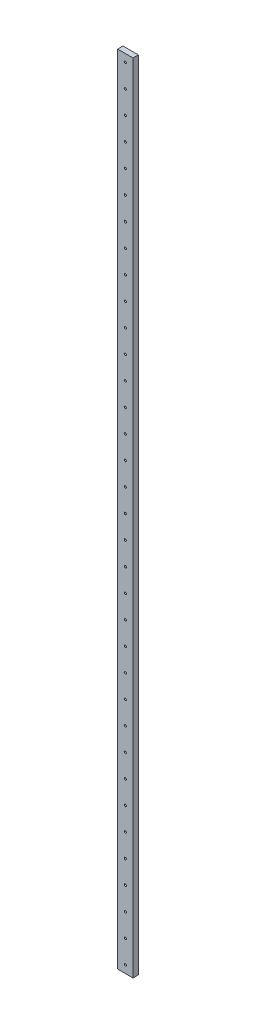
ISO-10303-21;
HEADER;
FILE_DESCRIPTION(('STEP AP214'),'2;1');
FILE_NAME('part.step','',(''),(''),'','','');
FILE_SCHEMA(('AUTOMOTIVE_DESIGN { 1 0 10303 214 1 1 1 1 }'));
ENDSEC;
DATA;
#1=APPLICATION_CONTEXT('core data for automotive mechanical design processes');
#2=APPLICATION_PROTOCOL_DEFINITION('international standard','automotive_design',2000,#1);
#3=PRODUCT_CONTEXT('',#1,'mechanical');
#4=PRODUCT('Part','Part','',(#3));
#5=PRODUCT_RELATED_PRODUCT_CATEGORY('part','',(#4));
#6=PRODUCT_DEFINITION_FORMATION('','',#4);
#7=PRODUCT_DEFINITION_CONTEXT('part definition',#1,'design');
#8=PRODUCT_DEFINITION('design','',#6,#7);
#9=PRODUCT_DEFINITION_SHAPE('','',#8);
#10=(LENGTH_UNIT() NAMED_UNIT(*) SI_UNIT(.MILLI.,.METRE.));
#11=(NAMED_UNIT(*) PLANE_ANGLE_UNIT() SI_UNIT($,.RADIAN.));
#12=(NAMED_UNIT(*) SI_UNIT($,.STERADIAN.) SOLID_ANGLE_UNIT());
#13=UNCERTAINTY_MEASURE_WITH_UNIT(LENGTH_MEASURE(1.E-05),#10,'distance_accuracy_value','');
#14=(GEOMETRIC_REPRESENTATION_CONTEXT(3) GLOBAL_UNCERTAINTY_ASSIGNED_CONTEXT((#13)) GLOBAL_UNIT_ASSIGNED_CONTEXT((#10,
#11,#12)) REPRESENTATION_CONTEXT('',''));
#15=CARTESIAN_POINT('',(0.,0.,0.));
#16=DIRECTION('',(0.,0.,1.));
#17=DIRECTION('',(1.,0.,0.));
#18=AXIS2_PLACEMENT_3D('',#15,#16,#17);
#19=CARTESIAN_POINT('',(-50.0056480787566,-5199.99989544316,-26.4501709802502));
#20=DIRECTION('',(0.,0.,1.));
#21=DIRECTION('',(0.,-1.,0.));
#22=AXIS2_PLACEMENT_3D('',#19,#20,#21);
#23=PLANE('',#22);
#24=DIRECTION('',(-0.999999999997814,2.09112818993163E-06,0.));
#25=VECTOR('',#24,1.);
#26=CARTESIAN_POINT('',(-49.9947742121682,0.000104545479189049,-26.4501709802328));
#27=LINE('',#26,#25);
#28=CARTESIAN_POINT('',(-49.9947742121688,0.000104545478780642,-26.4501709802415));
#29=VERTEX_POINT('',#28);
#30=CARTESIAN_POINT('',(50.0052257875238,-0.000104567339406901,-26.4501709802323));
#31=VERTEX_POINT('',#30);
#32=EDGE_CURVE('E1018',#29,#31,#27,.F.);
#33=ORIENTED_EDGE('',*,*,#32,.F.);
#34=DIRECTION('',(-2.09112818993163E-06,-0.999999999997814,0.));
#35=VECTOR('',#34,1.);
#36=CARTESIAN_POINT('',(-50.0056480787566,-5199.99989544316,-26.4501709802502));
#37=LINE('',#36,#35);
#38=CARTESIAN_POINT('',(-50.0056480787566,-5199.99989544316,-26.4501709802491));
#39=VERTEX_POINT('',#38);
#40=EDGE_CURVE('E1013',#39,#29,#37,.F.);
#41=ORIENTED_EDGE('',*,*,#40,.F.);
#42=DIRECTION('',(0.999999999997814,-2.09112818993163E-06,0.));
#43=VECTOR('',#42,1.);
#44=CARTESIAN_POINT('',(49.9943519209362,-5200.00010455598,-26.450170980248));
#45=LINE('',#44,#43);
#46=CARTESIAN_POINT('',(49.9943519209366,-5200.00010455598,-26.4501709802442));
#47=VERTEX_POINT('',#46);
#48=EDGE_CURVE('E1007',#47,#39,#45,.F.);
#49=ORIENTED_EDGE('',*,*,#48,.F.);
#50=DIRECTION('',(2.09112818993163E-06,0.999999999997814,0.));
#51=VECTOR('',#50,1.);
#52=CARTESIAN_POINT('',(49.9943519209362,-5200.00010455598,-26.4501709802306));
#53=LINE('',#52,#51);
#54=EDGE_CURVE('E698',#31,#47,#53,.F.);
#55=ORIENTED_EDGE('',*,*,#54,.F.);
#56=EDGE_LOOP('',(#33,#41,#49,#55));
#57=FACE_BOUND('',#56,.T.);
#58=CARTESIAN_POINT('',(0.000102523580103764,-50.0000000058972,-26.4501709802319));
#59=DIRECTION('',(0.,0.,1.));
#60=DIRECTION('',(1.,0.,0.));
#61=AXIS2_PLACEMENT_3D('',#58,#59,#60);
#62=CIRCLE('',#61,7.00000000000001);
#63=CARTESIAN_POINT('',(0.000117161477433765,-43.0000000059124,-26.4501709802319));
#64=VERTEX_POINT('',#63);
#65=CARTESIAN_POINT('',(8.78856827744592E-05,-57.0000000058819,-26.4501709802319));
#66=VERTEX_POINT('',#65);
#67=EDGE_CURVE('E692',#64,#66,#62,.F.);
#68=ORIENTED_EDGE('',*,*,#67,.T.);
#69=CARTESIAN_POINT('',(0.000102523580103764,-50.0000000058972,-26.4501709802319));
#70=DIRECTION('',(0.,0.,1.));
#71=DIRECTION('',(1.,0.,0.));
#72=AXIS2_PLACEMENT_3D('',#69,#70,#71);
#73=CIRCLE('',#72,7.00000000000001);
#74=EDGE_CURVE('E690',#66,#64,#73,.F.);
#75=ORIENTED_EDGE('',*,*,#74,.T.);
#76=EDGE_LOOP('',(#68,#75));
#77=FACE_BOUND('',#76,.T.);
#78=CARTESIAN_POINT('',(0.000102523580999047,-200.000000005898,-26.4501709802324));
#79=DIRECTION('',(0.,0.,1.));
#80=DIRECTION('',(1.,0.,0.));
#81=AXIS2_PLACEMENT_3D('',#78,#79,#80);
#82=CIRCLE('',#81,7.00000000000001);
#83=CARTESIAN_POINT('',(8.78856836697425E-05,-207.000000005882,-26.4501709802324));
#84=VERTEX_POINT('',#83);
#85=CARTESIAN_POINT('',(0.000117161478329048,-193.000000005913,-26.4501709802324));
#86=VERTEX_POINT('',#85);
#87=EDGE_CURVE('E686',#84,#86,#82,.F.);
#88=ORIENTED_EDGE('',*,*,#87,.T.);
#89=CARTESIAN_POINT('',(0.000102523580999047,-200.000000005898,-26.4501709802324));
#90=DIRECTION('',(0.,0.,1.));
#91=DIRECTION('',(1.,0.,0.));
#92=AXIS2_PLACEMENT_3D('',#89,#90,#91);
#93=CIRCLE('',#92,7.00000000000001);
#94=EDGE_CURVE('E684',#86,#84,#93,.F.);
#95=ORIENTED_EDGE('',*,*,#94,.T.);
#96=EDGE_LOOP('',(#88,#95));
#97=FACE_BOUND('',#96,.T.);
#98=CARTESIAN_POINT('',(0.000102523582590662,-350.000000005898,-26.4501709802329));
#99=DIRECTION('',(0.,0.,1.));
#100=DIRECTION('',(1.,0.,0.));
#101=AXIS2_PLACEMENT_3D('',#98,#99,#100);
#102=CIRCLE('',#101,7.00000000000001);
#103=CARTESIAN_POINT('',(8.78856852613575E-05,-357.000000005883,-26.4501709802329));
#104=VERTEX_POINT('',#103);
#105=CARTESIAN_POINT('',(0.000117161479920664,-343.000000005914,-26.4501709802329));
#106=VERTEX_POINT('',#105);
#107=EDGE_CURVE('E680',#104,#106,#102,.F.);
#108=ORIENTED_EDGE('',*,*,#107,.T.);
#109=CARTESIAN_POINT('',(0.000102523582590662,-350.000000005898,-26.4501709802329));
#110=DIRECTION('',(0.,0.,1.));
#111=DIRECTION('',(1.,0.,0.));
#112=AXIS2_PLACEMENT_3D('',#109,#110,#111);
#113=CIRCLE('',#112,7.00000000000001);
#114=EDGE_CURVE('E678',#106,#104,#113,.F.);
#115=ORIENTED_EDGE('',*,*,#114,.T.);
#116=EDGE_LOOP('',(#108,#115));
#117=FACE_BOUND('',#116,.T.);
#118=CARTESIAN_POINT('',(0.000102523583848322,-500.000000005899,-26.4501709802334));
#119=DIRECTION('',(0.,0.,1.));
#120=DIRECTION('',(0.,-1.,0.));
#121=AXIS2_PLACEMENT_3D('',#118,#119,#120);
#122=CIRCLE('',#121,7.);
#123=CARTESIAN_POINT('',(7.00010252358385,-500.000000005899,-26.4501709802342));
#124=VERTEX_POINT('',#123);
#125=CARTESIAN_POINT('',(-6.99989747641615,-500.000000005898,-26.4501709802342));
#126=VERTEX_POINT('',#125);
#127=EDGE_CURVE('E674',#124,#126,#122,.F.);
#128=ORIENTED_EDGE('',*,*,#127,.T.);
#129=CARTESIAN_POINT('',(0.000102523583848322,-500.000000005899,-26.450170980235));
#130=DIRECTION('',(0.,0.,1.));
#131=DIRECTION('',(0.,-1.,0.));
#132=AXIS2_PLACEMENT_3D('',#129,#130,#131);
#133=CIRCLE('',#132,7.);
#134=EDGE_CURVE('E672',#126,#124,#133,.F.);
#135=ORIENTED_EDGE('',*,*,#134,.T.);
#136=EDGE_LOOP('',(#128,#135));
#137=FACE_BOUND('',#136,.T.);
#138=CARTESIAN_POINT('',(0.000102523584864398,-650.000000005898,-26.4501709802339));
#139=DIRECTION('',(0.,0.,1.));
#140=DIRECTION('',(1.,0.,0.));
#141=AXIS2_PLACEMENT_3D('',#138,#139,#140);
#142=CIRCLE('',#141,7.00000000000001);
#143=CARTESIAN_POINT('',(8.78856875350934E-05,-657.000000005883,-26.4501709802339));
#144=VERTEX_POINT('',#143);
#145=CARTESIAN_POINT('',(0.000117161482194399,-643.000000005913,-26.4501709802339));
#146=VERTEX_POINT('',#145);
#147=EDGE_CURVE('E668',#144,#146,#142,.F.);
#148=ORIENTED_EDGE('',*,*,#147,.T.);
#149=CARTESIAN_POINT('',(0.000102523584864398,-650.000000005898,-26.4501709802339));
#150=DIRECTION('',(0.,0.,1.));
#151=DIRECTION('',(1.,0.,0.));
#152=AXIS2_PLACEMENT_3D('',#149,#150,#151);
#153=CIRCLE('',#152,7.00000000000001);
#154=EDGE_CURVE('E666',#146,#144,#153,.F.);
#155=ORIENTED_EDGE('',*,*,#154,.T.);
#156=EDGE_LOOP('',(#148,#155));
#157=FACE_BOUND('',#156,.T.);
#158=CARTESIAN_POINT('',(0.000102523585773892,-800.000000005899,-26.4501709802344));
#159=DIRECTION('',(0.,0.,1.));
#160=DIRECTION('',(1.,0.,0.));
#161=AXIS2_PLACEMENT_3D('',#158,#159,#160);
#162=CIRCLE('',#161,7.00000000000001);
#163=CARTESIAN_POINT('',(8.78856884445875E-05,-807.000000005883,-26.4501709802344));
#164=VERTEX_POINT('',#163);
#165=CARTESIAN_POINT('',(0.000117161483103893,-793.000000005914,-26.4501709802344));
#166=VERTEX_POINT('',#165);
#167=EDGE_CURVE('E662',#164,#166,#162,.F.);
#168=ORIENTED_EDGE('',*,*,#167,.T.);
#169=CARTESIAN_POINT('',(0.000102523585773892,-800.000000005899,-26.4501709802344));
#170=DIRECTION('',(0.,0.,1.));
#171=DIRECTION('',(1.,0.,0.));
#172=AXIS2_PLACEMENT_3D('',#169,#170,#171);
#173=CIRCLE('',#172,7.00000000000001);
#174=EDGE_CURVE('E660',#166,#164,#173,.F.);
#175=ORIENTED_EDGE('',*,*,#174,.T.);
#176=EDGE_LOOP('',(#168,#175));
#177=FACE_BOUND('',#176,.T.);
#178=CARTESIAN_POINT('',(0.000102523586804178,-950.000000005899,-26.4501709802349));
#179=DIRECTION('',(0.,0.,1.));
#180=DIRECTION('',(0.,-1.,0.));
#181=AXIS2_PLACEMENT_3D('',#178,#179,#180);
#182=CIRCLE('',#181,7.);
#183=CARTESIAN_POINT('',(7.00010252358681,-950.000000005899,-26.4501709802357));
#184=VERTEX_POINT('',#183);
#185=CARTESIAN_POINT('',(-6.9998974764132,-950.000000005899,-26.4501709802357));
#186=VERTEX_POINT('',#185);
#187=EDGE_CURVE('E656',#184,#186,#182,.F.);
#188=ORIENTED_EDGE('',*,*,#187,.T.);
#189=CARTESIAN_POINT('',(0.000102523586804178,-950.000000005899,-26.4501709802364));
#190=DIRECTION('',(0.,0.,1.));
#191=DIRECTION('',(0.,-1.,0.));
#192=AXIS2_PLACEMENT_3D('',#189,#190,#191);
#193=CIRCLE('',#192,7.);
#194=EDGE_CURVE('E654',#186,#184,#193,.F.);
#195=ORIENTED_EDGE('',*,*,#194,.T.);
#196=EDGE_LOOP('',(#188,#195));
#197=FACE_BOUND('',#196,.T.);
#198=CARTESIAN_POINT('',(0.00010252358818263,-1100.0000000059,-26.4501709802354));
#199=DIRECTION('',(0.,0.,1.));
#200=DIRECTION('',(1.,0.,0.));
#201=AXIS2_PLACEMENT_3D('',#198,#199,#200);
#202=CIRCLE('',#201,7.00000000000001);
#203=CARTESIAN_POINT('',(0.000117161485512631,-1093.00000000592,-26.4501709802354));
#204=VERTEX_POINT('',#203);
#205=CARTESIAN_POINT('',(8.78856908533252E-05,-1107.00000000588,-26.4501709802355));
#206=VERTEX_POINT('',#205);
#207=EDGE_CURVE('E650',#204,#206,#202,.F.);
#208=ORIENTED_EDGE('',*,*,#207,.T.);
#209=CARTESIAN_POINT('',(0.00010252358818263,-1100.0000000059,-26.4501709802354));
#210=DIRECTION('',(0.,0.,1.));
#211=DIRECTION('',(1.,0.,0.));
#212=AXIS2_PLACEMENT_3D('',#209,#210,#211);
#213=CIRCLE('',#212,7.00000000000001);
#214=EDGE_CURVE('E648',#206,#204,#213,.F.);
#215=ORIENTED_EDGE('',*,*,#214,.T.);
#216=EDGE_LOOP('',(#208,#215));
#217=FACE_BOUND('',#216,.T.);
#218=CARTESIAN_POINT('',(0.000102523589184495,-1250.0000000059,-26.4501709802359));
#219=DIRECTION('',(0.,0.,1.));
#220=DIRECTION('',(1.,0.,0.));
#221=AXIS2_PLACEMENT_3D('',#218,#219,#220);
#222=CIRCLE('',#221,7.00000000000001);
#223=CARTESIAN_POINT('',(8.78856918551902E-05,-1257.00000000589,-26.4501709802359));
#224=VERTEX_POINT('',#223);
#225=CARTESIAN_POINT('',(0.000117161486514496,-1243.00000000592,-26.4501709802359));
#226=VERTEX_POINT('',#225);
#227=EDGE_CURVE('E644',#224,#226,#222,.F.);
#228=ORIENTED_EDGE('',*,*,#227,.T.);
#229=CARTESIAN_POINT('',(0.000102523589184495,-1250.0000000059,-26.4501709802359));
#230=DIRECTION('',(0.,0.,1.));
#231=DIRECTION('',(1.,0.,0.));
#232=AXIS2_PLACEMENT_3D('',#229,#230,#231);
#233=CIRCLE('',#232,7.00000000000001);
#234=EDGE_CURVE('E642',#226,#224,#233,.F.);
#235=ORIENTED_EDGE('',*,*,#234,.T.);
#236=EDGE_LOOP('',(#228,#235));
#237=FACE_BOUND('',#236,.T.);
#238=CARTESIAN_POINT('',(0.000102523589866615,-1400.0000000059,-26.4501709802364));
#239=DIRECTION('',(0.,0.,1.));
#240=DIRECTION('',(1.,0.,0.));
#241=AXIS2_PLACEMENT_3D('',#238,#239,#240);
#242=CIRCLE('',#241,7.00000000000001);
#243=CARTESIAN_POINT('',(8.78856925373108E-05,-1407.00000000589,-26.4501709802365));
#244=VERTEX_POINT('',#243);
#245=CARTESIAN_POINT('',(0.000117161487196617,-1393.00000000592,-26.4501709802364));
#246=VERTEX_POINT('',#245);
#247=EDGE_CURVE('E638',#244,#246,#242,.F.);
#248=ORIENTED_EDGE('',*,*,#247,.T.);
#249=CARTESIAN_POINT('',(0.000102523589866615,-1400.0000000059,-26.4501709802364));
#250=DIRECTION('',(0.,0.,1.));
#251=DIRECTION('',(1.,0.,0.));
#252=AXIS2_PLACEMENT_3D('',#249,#250,#251);
#253=CIRCLE('',#252,7.00000000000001);
#254=EDGE_CURVE('E636',#246,#244,#253,.F.);
#255=ORIENTED_EDGE('',*,*,#254,.T.);
#256=EDGE_LOOP('',(#248,#255));
#257=FACE_BOUND('',#256,.T.);
#258=CARTESIAN_POINT('',(0.000102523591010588,-1550.0000000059,-26.4501709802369));
#259=DIRECTION('',(0.,0.,1.));
#260=DIRECTION('',(0.,-1.,0.));
#261=AXIS2_PLACEMENT_3D('',#258,#259,#260);
#262=CIRCLE('',#261,7.);
#263=CARTESIAN_POINT('',(7.00010252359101,-1550.0000000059,-26.4501709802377));
#264=VERTEX_POINT('',#263);
#265=CARTESIAN_POINT('',(-6.99989747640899,-1550.0000000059,-26.4501709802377));
#266=VERTEX_POINT('',#265);
#267=EDGE_CURVE('E632',#264,#266,#262,.F.);
#268=ORIENTED_EDGE('',*,*,#267,.T.);
#269=CARTESIAN_POINT('',(0.000102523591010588,-1550.0000000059,-26.4501709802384));
#270=DIRECTION('',(0.,0.,1.));
#271=DIRECTION('',(0.,-1.,0.));
#272=AXIS2_PLACEMENT_3D('',#269,#270,#271);
#273=CIRCLE('',#272,7.);
#274=EDGE_CURVE('E630',#266,#264,#273,.F.);
#275=ORIENTED_EDGE('',*,*,#274,.T.);
#276=EDGE_LOOP('',(#268,#275));
#277=FACE_BOUND('',#276,.T.);
#278=CARTESIAN_POINT('',(0.000102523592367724,-1700.0000000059,-26.4501709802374));
#279=DIRECTION('',(0.,0.,1.));
#280=DIRECTION('',(1.,0.,0.));
#281=AXIS2_PLACEMENT_3D('',#278,#279,#280);
#282=CIRCLE('',#281,7.00000000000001);
#283=CARTESIAN_POINT('',(8.78856950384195E-05,-1707.00000000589,-26.4501709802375));
#284=VERTEX_POINT('',#283);
#285=CARTESIAN_POINT('',(0.000117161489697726,-1693.00000000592,-26.4501709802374));
#286=VERTEX_POINT('',#285);
#287=EDGE_CURVE('E626',#284,#286,#282,.F.);
#288=ORIENTED_EDGE('',*,*,#287,.T.);
#289=CARTESIAN_POINT('',(0.000102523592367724,-1700.0000000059,-26.4501709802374));
#290=DIRECTION('',(0.,0.,1.));
#291=DIRECTION('',(1.,0.,0.));
#292=AXIS2_PLACEMENT_3D('',#289,#290,#291);
#293=CIRCLE('',#292,7.00000000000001);
#294=EDGE_CURVE('E624',#286,#284,#293,.F.);
#295=ORIENTED_EDGE('',*,*,#294,.T.);
#296=EDGE_LOOP('',(#288,#295));
#297=FACE_BOUND('',#296,.T.);
#298=CARTESIAN_POINT('',(0.000102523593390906,-1850.0000000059,-26.4501709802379));
#299=DIRECTION('',(0.,0.,1.));
#300=DIRECTION('',(1.,0.,0.));
#301=AXIS2_PLACEMENT_3D('',#298,#299,#300);
#302=CIRCLE('',#301,7.00000000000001);
#303=CARTESIAN_POINT('',(8.78856960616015E-05,-1857.00000000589,-26.450170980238));
#304=VERTEX_POINT('',#303);
#305=CARTESIAN_POINT('',(0.000117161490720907,-1843.00000000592,-26.4501709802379));
#306=VERTEX_POINT('',#305);
#307=EDGE_CURVE('E620',#304,#306,#302,.F.);
#308=ORIENTED_EDGE('',*,*,#307,.T.);
#309=CARTESIAN_POINT('',(0.000102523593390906,-1850.0000000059,-26.4501709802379));
#310=DIRECTION('',(0.,0.,1.));
#311=DIRECTION('',(1.,0.,0.));
#312=AXIS2_PLACEMENT_3D('',#309,#310,#311);
#313=CIRCLE('',#312,7.00000000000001);
#314=EDGE_CURVE('E618',#306,#304,#313,.F.);
#315=ORIENTED_EDGE('',*,*,#314,.T.);
#316=EDGE_LOOP('',(#308,#315));
#317=FACE_BOUND('',#316,.T.);
#318=CARTESIAN_POINT('',(0.000102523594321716,-2000.0000000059,-26.4501709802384));
#319=DIRECTION('',(0.,0.,1.));
#320=DIRECTION('',(1.,0.,0.));
#321=AXIS2_PLACEMENT_3D('',#318,#319,#320);
#322=CIRCLE('',#321,7.00000000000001);
#323=CARTESIAN_POINT('',(0.000117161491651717,-1993.00000000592,-26.4501709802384));
#324=VERTEX_POINT('',#323);
#325=CARTESIAN_POINT('',(8.78856969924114E-05,-2007.00000000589,-26.4501709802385));
#326=VERTEX_POINT('',#325);
#327=EDGE_CURVE('E614',#324,#326,#322,.F.);
#328=ORIENTED_EDGE('',*,*,#327,.T.);
#329=CARTESIAN_POINT('',(0.000102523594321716,-2000.0000000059,-26.4501709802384));
#330=DIRECTION('',(0.,0.,1.));
#331=DIRECTION('',(1.,0.,0.));
#332=AXIS2_PLACEMENT_3D('',#329,#330,#331);
#333=CIRCLE('',#332,7.00000000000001);
#334=EDGE_CURVE('E612',#326,#324,#333,.F.);
#335=ORIENTED_EDGE('',*,*,#334,.T.);
#336=EDGE_LOOP('',(#328,#335));
#337=FACE_BOUND('',#336,.T.);
#338=CARTESIAN_POINT('',(0.000102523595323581,-2150.0000000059,-26.4501709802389));
#339=DIRECTION('',(0.,0.,1.));
#340=DIRECTION('',(1.,0.,0.));
#341=AXIS2_PLACEMENT_3D('',#338,#339,#340);
#342=CIRCLE('',#341,7.00000000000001);
#343=CARTESIAN_POINT('',(8.78856979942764E-05,-2157.00000000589,-26.450170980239));
#344=VERTEX_POINT('',#343);
#345=CARTESIAN_POINT('',(0.000117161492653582,-2143.00000000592,-26.4501709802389));
#346=VERTEX_POINT('',#345);
#347=EDGE_CURVE('E608',#344,#346,#342,.F.);
#348=ORIENTED_EDGE('',*,*,#347,.T.);
#349=CARTESIAN_POINT('',(0.000102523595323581,-2150.0000000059,-26.4501709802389));
#350=DIRECTION('',(0.,0.,1.));
#351=DIRECTION('',(1.,0.,0.));
#352=AXIS2_PLACEMENT_3D('',#349,#350,#351);
#353=CIRCLE('',#352,7.00000000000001);
#354=EDGE_CURVE('E606',#346,#344,#353,.F.);
#355=ORIENTED_EDGE('',*,*,#354,.T.);
#356=EDGE_LOOP('',(#348,#355));
#357=FACE_BOUND('',#356,.T.);
#358=CARTESIAN_POINT('',(0.000102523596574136,-2300.0000000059,-26.4501709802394));
#359=DIRECTION('',(0.,0.,1.));
#360=DIRECTION('',(1.,0.,0.));
#361=AXIS2_PLACEMENT_3D('',#358,#359,#360);
#362=CIRCLE('',#361,7.00000000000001);
#363=CARTESIAN_POINT('',(8.78856992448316E-05,-2307.00000000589,-26.4501709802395));
#364=VERTEX_POINT('',#363);
#365=CARTESIAN_POINT('',(0.000117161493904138,-2293.00000000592,-26.4501709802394));
#366=VERTEX_POINT('',#365);
#367=EDGE_CURVE('E602',#364,#366,#362,.F.);
#368=ORIENTED_EDGE('',*,*,#367,.T.);
#369=CARTESIAN_POINT('',(0.000102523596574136,-2300.0000000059,-26.4501709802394));
#370=DIRECTION('',(0.,0.,1.));
#371=DIRECTION('',(1.,0.,0.));
#372=AXIS2_PLACEMENT_3D('',#369,#370,#371);
#373=CIRCLE('',#372,7.00000000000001);
#374=EDGE_CURVE('E600',#366,#364,#373,.F.);
#375=ORIENTED_EDGE('',*,*,#374,.T.);
#376=EDGE_LOOP('',(#368,#375));
#377=FACE_BOUND('',#376,.T.);
#378=CARTESIAN_POINT('',(0.000102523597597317,-2450.0000000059,-26.4501709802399));
#379=DIRECTION('',(0.,0.,1.));
#380=DIRECTION('',(1.,0.,0.));
#381=AXIS2_PLACEMENT_3D('',#378,#379,#380);
#382=CIRCLE('',#381,7.00000000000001);
#383=CARTESIAN_POINT('',(8.78857002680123E-05,-2457.00000000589,-26.45017098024));
#384=VERTEX_POINT('',#383);
#385=CARTESIAN_POINT('',(0.000117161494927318,-2443.00000000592,-26.4501709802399));
#386=VERTEX_POINT('',#385);
#387=EDGE_CURVE('E596',#384,#386,#382,.F.);
#388=ORIENTED_EDGE('',*,*,#387,.T.);
#389=CARTESIAN_POINT('',(0.000102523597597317,-2450.0000000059,-26.4501709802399));
#390=DIRECTION('',(0.,0.,1.));
#391=DIRECTION('',(1.,0.,0.));
#392=AXIS2_PLACEMENT_3D('',#389,#390,#391);
#393=CIRCLE('',#392,7.00000000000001);
#394=EDGE_CURVE('E594',#386,#384,#393,.F.);
#395=ORIENTED_EDGE('',*,*,#394,.T.);
#396=EDGE_LOOP('',(#388,#395));
#397=FACE_BOUND('',#396,.T.);
#398=CARTESIAN_POINT('',(0.000102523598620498,-2600.0000000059,-26.4501709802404));
#399=DIRECTION('',(0.,0.,1.));
#400=DIRECTION('',(1.,0.,0.));
#401=AXIS2_PLACEMENT_3D('',#398,#399,#400);
#402=CIRCLE('',#401,7.00000000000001);
#403=CARTESIAN_POINT('',(8.78857012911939E-05,-2607.00000000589,-26.4501709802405));
#404=VERTEX_POINT('',#403);
#405=CARTESIAN_POINT('',(0.0001171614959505,-2593.00000000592,-26.4501709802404));
#406=VERTEX_POINT('',#405);
#407=EDGE_CURVE('E590',#404,#406,#402,.F.);
#408=ORIENTED_EDGE('',*,*,#407,.T.);
#409=CARTESIAN_POINT('',(0.000102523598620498,-2600.0000000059,-26.4501709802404));
#410=DIRECTION('',(0.,0.,1.));
#411=DIRECTION('',(1.,0.,0.));
#412=AXIS2_PLACEMENT_3D('',#409,#410,#411);
#413=CIRCLE('',#412,7.00000000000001);
#414=EDGE_CURVE('E588',#406,#404,#413,.F.);
#415=ORIENTED_EDGE('',*,*,#414,.T.);
#416=EDGE_LOOP('',(#408,#415));
#417=FACE_BOUND('',#416,.T.);
#418=CARTESIAN_POINT('',(0.000102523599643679,-2750.0000000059,-26.4501709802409));
#419=DIRECTION('',(0.,0.,1.));
#420=DIRECTION('',(1.,0.,0.));
#421=AXIS2_PLACEMENT_3D('',#418,#419,#420);
#422=CIRCLE('',#421,7.00000000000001);
#423=CARTESIAN_POINT('',(8.78857023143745E-05,-2757.00000000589,-26.450170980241));
#424=VERTEX_POINT('',#423);
#425=CARTESIAN_POINT('',(0.000117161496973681,-2743.00000000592,-26.4501709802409));
#426=VERTEX_POINT('',#425);
#427=EDGE_CURVE('E584',#424,#426,#422,.F.);
#428=ORIENTED_EDGE('',*,*,#427,.T.);
#429=CARTESIAN_POINT('',(0.000102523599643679,-2750.0000000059,-26.4501709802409));
#430=DIRECTION('',(0.,0.,1.));
#431=DIRECTION('',(1.,0.,0.));
#432=AXIS2_PLACEMENT_3D('',#429,#430,#431);
#433=CIRCLE('',#432,7.00000000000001);
#434=EDGE_CURVE('E582',#426,#424,#433,.F.);
#435=ORIENTED_EDGE('',*,*,#434,.T.);
#436=EDGE_LOOP('',(#428,#435));
#437=FACE_BOUND('',#436,.T.);
#438=CARTESIAN_POINT('',(0.000102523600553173,-2900.0000000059,-26.4501709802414));
#439=DIRECTION('',(0.,0.,1.));
#440=DIRECTION('',(1.,0.,0.));
#441=AXIS2_PLACEMENT_3D('',#438,#439,#440);
#442=CIRCLE('',#441,7.00000000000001);
#443=CARTESIAN_POINT('',(8.78857032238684E-05,-2907.00000000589,-26.4501709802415));
#444=VERTEX_POINT('',#443);
#445=CARTESIAN_POINT('',(0.000117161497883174,-2893.00000000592,-26.4501709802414));
#446=VERTEX_POINT('',#445);
#447=EDGE_CURVE('E578',#444,#446,#442,.F.);
#448=ORIENTED_EDGE('',*,*,#447,.T.);
#449=CARTESIAN_POINT('',(0.000102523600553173,-2900.0000000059,-26.4501709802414));
#450=DIRECTION('',(0.,0.,1.));
#451=DIRECTION('',(1.,0.,0.));
#452=AXIS2_PLACEMENT_3D('',#449,#450,#451);
#453=CIRCLE('',#452,7.00000000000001);
#454=EDGE_CURVE('E576',#446,#444,#453,.F.);
#455=ORIENTED_EDGE('',*,*,#454,.T.);
#456=EDGE_LOOP('',(#448,#455));
#457=FACE_BOUND('',#456,.T.);
#458=CARTESIAN_POINT('',(0.000102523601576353,-3050.0000000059,-26.4501709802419));
#459=DIRECTION('',(0.,0.,1.));
#460=DIRECTION('',(1.,0.,0.));
#461=AXIS2_PLACEMENT_3D('',#458,#459,#460);
#462=CIRCLE('',#461,7.00000000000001);
#463=CARTESIAN_POINT('',(8.78857042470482E-05,-3057.00000000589,-26.450170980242));
#464=VERTEX_POINT('',#463);
#465=CARTESIAN_POINT('',(0.000117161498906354,-3043.00000000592,-26.4501709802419));
#466=VERTEX_POINT('',#465);
#467=EDGE_CURVE('E572',#464,#466,#462,.F.);
#468=ORIENTED_EDGE('',*,*,#467,.T.);
#469=CARTESIAN_POINT('',(0.000102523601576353,-3050.0000000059,-26.4501709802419));
#470=DIRECTION('',(0.,0.,1.));
#471=DIRECTION('',(1.,0.,0.));
#472=AXIS2_PLACEMENT_3D('',#469,#470,#471);
#473=CIRCLE('',#472,7.00000000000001);
#474=EDGE_CURVE('E570',#466,#464,#473,.F.);
#475=ORIENTED_EDGE('',*,*,#474,.T.);
#476=EDGE_LOOP('',(#468,#475));
#477=FACE_BOUND('',#476,.T.);
#478=CARTESIAN_POINT('',(0.000102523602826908,-3200.0000000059,-26.4501709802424));
#479=DIRECTION('',(0.,0.,1.));
#480=DIRECTION('',(1.,0.,0.));
#481=AXIS2_PLACEMENT_3D('',#478,#479,#480);
#482=CIRCLE('',#481,7.00000000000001);
#483=CARTESIAN_POINT('',(8.78857054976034E-05,-3207.00000000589,-26.4501709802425));
#484=VERTEX_POINT('',#483);
#485=CARTESIAN_POINT('',(0.000117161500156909,-3193.00000000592,-26.4501709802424));
#486=VERTEX_POINT('',#485);
#487=EDGE_CURVE('E566',#484,#486,#482,.F.);
#488=ORIENTED_EDGE('',*,*,#487,.T.);
#489=CARTESIAN_POINT('',(0.000102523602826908,-3200.0000000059,-26.4501709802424));
#490=DIRECTION('',(0.,0.,1.));
#491=DIRECTION('',(1.,0.,0.));
#492=AXIS2_PLACEMENT_3D('',#489,#490,#491);
#493=CIRCLE('',#492,7.00000000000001);
#494=EDGE_CURVE('E564',#486,#484,#493,.F.);
#495=ORIENTED_EDGE('',*,*,#494,.T.);
#496=EDGE_LOOP('',(#488,#495));
#497=FACE_BOUND('',#496,.T.);
#498=CARTESIAN_POINT('',(0.000102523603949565,-3350.00000000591,-26.4501709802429));
#499=DIRECTION('',(0.,0.,1.));
#500=DIRECTION('',(1.,0.,0.));
#501=AXIS2_PLACEMENT_3D('',#498,#499,#500);
#502=CIRCLE('',#501,7.00000000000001);
#503=CARTESIAN_POINT('',(8.78857066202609E-05,-3357.00000000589,-26.450170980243));
#504=VERTEX_POINT('',#503);
#505=CARTESIAN_POINT('',(0.000117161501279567,-3343.00000000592,-26.4501709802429));
#506=VERTEX_POINT('',#505);
#507=EDGE_CURVE('E560',#504,#506,#502,.F.);
#508=ORIENTED_EDGE('',*,*,#507,.T.);
#509=CARTESIAN_POINT('',(0.000102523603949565,-3350.00000000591,-26.450170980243));
#510=DIRECTION('',(0.,0.,1.));
#511=DIRECTION('',(1.,0.,0.));
#512=AXIS2_PLACEMENT_3D('',#509,#510,#511);
#513=CIRCLE('',#512,7.00000000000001);
#514=EDGE_CURVE('E558',#506,#504,#513,.F.);
#515=ORIENTED_EDGE('',*,*,#514,.T.);
#516=EDGE_LOOP('',(#508,#515));
#517=FACE_BOUND('',#516,.T.);
#518=CARTESIAN_POINT('',(0.000102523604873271,-3500.00000000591,-26.4501709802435));
#519=DIRECTION('',(0.,0.,1.));
#520=DIRECTION('',(1.,0.,0.));
#521=AXIS2_PLACEMENT_3D('',#518,#519,#520);
#522=CIRCLE('',#521,7.00000000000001);
#523=CARTESIAN_POINT('',(8.78857075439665E-05,-3507.00000000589,-26.4501709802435));
#524=VERTEX_POINT('',#523);
#525=CARTESIAN_POINT('',(0.000117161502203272,-3493.00000000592,-26.4501709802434));
#526=VERTEX_POINT('',#525);
#527=EDGE_CURVE('E554',#524,#526,#522,.F.);
#528=ORIENTED_EDGE('',*,*,#527,.T.);
#529=CARTESIAN_POINT('',(0.000102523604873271,-3500.00000000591,-26.4501709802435));
#530=DIRECTION('',(0.,0.,1.));
#531=DIRECTION('',(1.,0.,0.));
#532=AXIS2_PLACEMENT_3D('',#529,#530,#531);
#533=CIRCLE('',#532,7.00000000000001);
#534=EDGE_CURVE('E552',#526,#524,#533,.F.);
#535=ORIENTED_EDGE('',*,*,#534,.T.);
#536=EDGE_LOOP('',(#528,#535));
#537=FACE_BOUND('',#536,.T.);
#538=CARTESIAN_POINT('',(0.000102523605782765,-3650.0000000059,-26.4501709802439));
#539=DIRECTION('',(0.,0.,1.));
#540=DIRECTION('',(1.,0.,0.));
#541=AXIS2_PLACEMENT_3D('',#538,#539,#540);
#542=CIRCLE('',#541,7.00000000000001);
#543=CARTESIAN_POINT('',(8.78857084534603E-05,-3657.00000000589,-26.450170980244));
#544=VERTEX_POINT('',#543);
#545=CARTESIAN_POINT('',(0.000117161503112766,-3643.00000000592,-26.4501709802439));
#546=VERTEX_POINT('',#545);
#547=EDGE_CURVE('E548',#544,#546,#542,.F.);
#548=ORIENTED_EDGE('',*,*,#547,.T.);
#549=CARTESIAN_POINT('',(0.000102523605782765,-3650.0000000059,-26.450170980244));
#550=DIRECTION('',(0.,0.,1.));
#551=DIRECTION('',(1.,0.,0.));
#552=AXIS2_PLACEMENT_3D('',#549,#550,#551);
#553=CIRCLE('',#552,7.00000000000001);
#554=EDGE_CURVE('E546',#546,#544,#553,.F.);
#555=ORIENTED_EDGE('',*,*,#554,.T.);
#556=EDGE_LOOP('',(#548,#555));
#557=FACE_BOUND('',#556,.T.);
#558=CARTESIAN_POINT('',(0.000102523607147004,-3800.00000000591,-26.4501709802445));
#559=DIRECTION('',(0.,0.,1.));
#560=DIRECTION('',(1.,0.,0.));
#561=AXIS2_PLACEMENT_3D('',#558,#559,#560);
#562=CIRCLE('',#561,7.00000000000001);
#563=CARTESIAN_POINT('',(8.78857098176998E-05,-3807.00000000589,-26.4501709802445));
#564=VERTEX_POINT('',#563);
#565=CARTESIAN_POINT('',(0.000117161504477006,-3793.00000000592,-26.4501709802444));
#566=VERTEX_POINT('',#565);
#567=EDGE_CURVE('E542',#564,#566,#562,.F.);
#568=ORIENTED_EDGE('',*,*,#567,.T.);
#569=CARTESIAN_POINT('',(0.000102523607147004,-3800.00000000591,-26.4501709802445));
#570=DIRECTION('',(0.,0.,1.));
#571=DIRECTION('',(1.,0.,0.));
#572=AXIS2_PLACEMENT_3D('',#569,#570,#571);
#573=CIRCLE('',#572,7.00000000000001);
#574=EDGE_CURVE('E540',#566,#564,#573,.F.);
#575=ORIENTED_EDGE('',*,*,#574,.T.);
#576=EDGE_LOOP('',(#568,#575));
#577=FACE_BOUND('',#576,.T.);
#578=CARTESIAN_POINT('',(0.000102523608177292,-3950.00000000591,-26.450170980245));
#579=DIRECTION('',(0.,0.,1.));
#580=DIRECTION('',(0.,-1.,0.));
#581=AXIS2_PLACEMENT_3D('',#578,#579,#580);
#582=CIRCLE('',#581,7.);
#583=CARTESIAN_POINT('',(7.00010252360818,-3950.00000000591,-26.4501709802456));
#584=VERTEX_POINT('',#583);
#585=CARTESIAN_POINT('',(-6.99989747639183,-3950.00000000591,-26.4501709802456));
#586=VERTEX_POINT('',#585);
#587=EDGE_CURVE('E536',#584,#586,#582,.F.);
#588=ORIENTED_EDGE('',*,*,#587,.T.);
#589=CARTESIAN_POINT('',(0.000102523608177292,-3950.00000000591,-26.4501709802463));
#590=DIRECTION('',(0.,0.,1.));
#591=DIRECTION('',(0.,-1.,0.));
#592=AXIS2_PLACEMENT_3D('',#589,#590,#591);
#593=CIRCLE('',#592,7.);
#594=EDGE_CURVE('E534',#586,#584,#593,.F.);
#595=ORIENTED_EDGE('',*,*,#594,.T.);
#596=EDGE_LOOP('',(#588,#595));
#597=FACE_BOUND('',#596,.T.);
#598=CARTESIAN_POINT('',(0.000102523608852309,-4100.00000000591,-26.4501709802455));
#599=DIRECTION('',(0.,0.,1.));
#600=DIRECTION('',(1.,0.,0.));
#601=AXIS2_PLACEMENT_3D('',#598,#599,#600);
#602=CIRCLE('',#601,7.00000000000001);
#603=CARTESIAN_POINT('',(8.78857115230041E-05,-4107.00000000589,-26.4501709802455));
#604=VERTEX_POINT('',#603);
#605=CARTESIAN_POINT('',(0.00011716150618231,-4093.00000000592,-26.4501709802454));
#606=VERTEX_POINT('',#605);
#607=EDGE_CURVE('E530',#604,#606,#602,.F.);
#608=ORIENTED_EDGE('',*,*,#607,.T.);
#609=CARTESIAN_POINT('',(0.000102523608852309,-4100.00000000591,-26.4501709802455));
#610=DIRECTION('',(0.,0.,1.));
#611=DIRECTION('',(1.,0.,0.));
#612=AXIS2_PLACEMENT_3D('',#609,#610,#611);
#613=CIRCLE('',#612,7.00000000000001);
#614=EDGE_CURVE('E528',#606,#604,#613,.F.);
#615=ORIENTED_EDGE('',*,*,#614,.T.);
#616=EDGE_LOOP('',(#608,#615));
#617=FACE_BOUND('',#616,.T.);
#618=CARTESIAN_POINT('',(0.000102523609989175,-4250.00000000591,-26.450170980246));
#619=DIRECTION('',(0.,0.,1.));
#620=DIRECTION('',(1.,0.,0.));
#621=AXIS2_PLACEMENT_3D('',#618,#619,#620);
#622=CIRCLE('',#621,7.00000000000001);
#623=CARTESIAN_POINT('',(8.78857126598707E-05,-4257.00000000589,-26.450170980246));
#624=VERTEX_POINT('',#623);
#625=CARTESIAN_POINT('',(0.000117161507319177,-4243.00000000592,-26.4501709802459));
#626=VERTEX_POINT('',#625);
#627=EDGE_CURVE('E524',#624,#626,#622,.F.);
#628=ORIENTED_EDGE('',*,*,#627,.T.);
#629=CARTESIAN_POINT('',(0.000102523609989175,-4250.00000000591,-26.450170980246));
#630=DIRECTION('',(0.,0.,1.));
#631=DIRECTION('',(1.,0.,0.));
#632=AXIS2_PLACEMENT_3D('',#629,#630,#631);
#633=CIRCLE('',#632,7.00000000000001);
#634=EDGE_CURVE('E522',#626,#624,#633,.F.);
#635=ORIENTED_EDGE('',*,*,#634,.T.);
#636=EDGE_LOOP('',(#628,#635));
#637=FACE_BOUND('',#636,.T.);
#638=CARTESIAN_POINT('',(0.000102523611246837,-4400.00000000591,-26.4501709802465));
#639=DIRECTION('',(0.,0.,1.));
#640=DIRECTION('',(0.,-1.,0.));
#641=AXIS2_PLACEMENT_3D('',#638,#639,#640);
#642=CIRCLE('',#641,7.);
#643=CARTESIAN_POINT('',(7.00010252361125,-4400.00000000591,-26.4501709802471));
#644=VERTEX_POINT('',#643);
#645=CARTESIAN_POINT('',(-6.99989747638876,-4400.00000000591,-26.4501709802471));
#646=VERTEX_POINT('',#645);
#647=EDGE_CURVE('E518',#644,#646,#642,.F.);
#648=ORIENTED_EDGE('',*,*,#647,.T.);
#649=CARTESIAN_POINT('',(0.000102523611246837,-4400.00000000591,-26.4501709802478));
#650=DIRECTION('',(0.,0.,1.));
#651=DIRECTION('',(0.,-1.,0.));
#652=AXIS2_PLACEMENT_3D('',#649,#650,#651);
#653=CIRCLE('',#652,7.);
#654=EDGE_CURVE('E516',#646,#644,#653,.F.);
#655=ORIENTED_EDGE('',*,*,#654,.T.);
#656=EDGE_LOOP('',(#648,#655));
#657=FACE_BOUND('',#656,.T.);
#658=CARTESIAN_POINT('',(0.000102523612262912,-4550.00000000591,-26.450170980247));
#659=DIRECTION('',(0.,0.,1.));
#660=DIRECTION('',(1.,0.,0.));
#661=AXIS2_PLACEMENT_3D('',#658,#659,#660);
#662=CIRCLE('',#661,7.00000000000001);
#663=CARTESIAN_POINT('',(8.78857149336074E-05,-4557.00000000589,-26.450170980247));
#664=VERTEX_POINT('',#663);
#665=CARTESIAN_POINT('',(0.000117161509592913,-4543.00000000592,-26.4501709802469));
#666=VERTEX_POINT('',#665);
#667=EDGE_CURVE('E512',#664,#666,#662,.F.);
#668=ORIENTED_EDGE('',*,*,#667,.T.);
#669=CARTESIAN_POINT('',(0.000102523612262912,-4550.00000000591,-26.450170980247));
#670=DIRECTION('',(0.,0.,1.));
#671=DIRECTION('',(1.,0.,0.));
#672=AXIS2_PLACEMENT_3D('',#669,#670,#671);
#673=CIRCLE('',#672,7.00000000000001);
#674=EDGE_CURVE('E510',#666,#664,#673,.F.);
#675=ORIENTED_EDGE('',*,*,#674,.T.);
#676=EDGE_LOOP('',(#668,#675));
#677=FACE_BOUND('',#676,.T.);
#678=CARTESIAN_POINT('',(0.000102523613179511,-4700.00000000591,-26.4501709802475));
#679=DIRECTION('',(0.,0.,1.));
#680=DIRECTION('',(0.,-1.,0.));
#681=AXIS2_PLACEMENT_3D('',#678,#679,#680);
#682=CIRCLE('',#681,7.);
#683=CARTESIAN_POINT('',(7.00010252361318,-4700.00000000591,-26.4501709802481));
#684=VERTEX_POINT('',#683);
#685=CARTESIAN_POINT('',(-6.99989747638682,-4700.00000000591,-26.4501709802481));
#686=VERTEX_POINT('',#685);
#687=EDGE_CURVE('E506',#684,#686,#682,.F.);
#688=ORIENTED_EDGE('',*,*,#687,.T.);
#689=CARTESIAN_POINT('',(0.000102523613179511,-4700.00000000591,-26.4501709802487));
#690=DIRECTION('',(0.,0.,1.));
#691=DIRECTION('',(0.,-1.,0.));
#692=AXIS2_PLACEMENT_3D('',#689,#690,#691);
#693=CIRCLE('',#692,7.);
#694=EDGE_CURVE('E504',#686,#684,#693,.F.);
#695=ORIENTED_EDGE('',*,*,#694,.T.);
#696=EDGE_LOOP('',(#688,#695));
#697=FACE_BOUND('',#696,.T.);
#698=CARTESIAN_POINT('',(0.000102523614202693,-4850.00000000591,-26.450170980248));
#699=DIRECTION('',(0.,0.,1.));
#700=DIRECTION('',(0.,-1.,0.));
#701=AXIS2_PLACEMENT_3D('',#698,#699,#700);
#702=CIRCLE('',#701,7.);
#703=CARTESIAN_POINT('',(7.00010252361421,-4850.00000000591,-26.4501709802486));
#704=VERTEX_POINT('',#703);
#705=CARTESIAN_POINT('',(-6.9998974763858,-4850.00000000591,-26.4501709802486));
#706=VERTEX_POINT('',#705);
#707=EDGE_CURVE('E500',#704,#706,#702,.F.);
#708=ORIENTED_EDGE('',*,*,#707,.T.);
#709=CARTESIAN_POINT('',(0.000102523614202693,-4850.00000000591,-26.4501709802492));
#710=DIRECTION('',(0.,0.,1.));
#711=DIRECTION('',(0.,-1.,0.));
#712=AXIS2_PLACEMENT_3D('',#709,#710,#711);
#713=CIRCLE('',#712,7.);
#714=EDGE_CURVE('E498',#706,#704,#713,.F.);
#715=ORIENTED_EDGE('',*,*,#714,.T.);
#716=EDGE_LOOP('',(#708,#715));
#717=FACE_BOUND('',#716,.T.);
#718=CARTESIAN_POINT('',(0.000102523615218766,-5000.00000000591,-26.4501709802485));
#719=DIRECTION('',(0.,0.,1.));
#720=DIRECTION('',(1.,0.,0.));
#721=AXIS2_PLACEMENT_3D('',#718,#719,#720);
#722=CIRCLE('',#721,7.00000000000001);
#723=CARTESIAN_POINT('',(8.78857178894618E-05,-5007.0000000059,-26.4501709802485));
#724=VERTEX_POINT('',#723);
#725=CARTESIAN_POINT('',(0.000117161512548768,-4993.00000000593,-26.4501709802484));
#726=VERTEX_POINT('',#725);
#727=EDGE_CURVE('E495',#724,#726,#722,.F.);
#728=ORIENTED_EDGE('',*,*,#727,.T.);
#729=CARTESIAN_POINT('',(0.000102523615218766,-5000.00000000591,-26.4501709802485));
#730=DIRECTION('',(0.,0.,1.));
#731=DIRECTION('',(1.,0.,0.));
#732=AXIS2_PLACEMENT_3D('',#729,#730,#731);
#733=CIRCLE('',#732,7.00000000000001);
#734=EDGE_CURVE('E488',#726,#724,#733,.F.);
#735=ORIENTED_EDGE('',*,*,#734,.T.);
#736=EDGE_LOOP('',(#728,#735));
#737=FACE_BOUND('',#736,.T.);
#738=CARTESIAN_POINT('',(0.000102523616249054,-5150.00000000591,-26.450170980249));
#739=DIRECTION('',(0.,0.,1.));
#740=DIRECTION('',(0.,-1.,0.));
#741=AXIS2_PLACEMENT_3D('',#738,#739,#740);
#742=CIRCLE('',#741,7.);
#743=CARTESIAN_POINT('',(7.00010252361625,-5150.00000000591,-26.4501709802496));
#744=VERTEX_POINT('',#743);
#745=CARTESIAN_POINT('',(-6.99989747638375,-5150.00000000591,-26.4501709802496));
#746=VERTEX_POINT('',#745);
#747=EDGE_CURVE('E475',#744,#746,#742,.F.);
#748=ORIENTED_EDGE('',*,*,#747,.T.);
#749=CARTESIAN_POINT('',(0.000102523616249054,-5150.00000000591,-26.4501709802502));
#750=DIRECTION('',(0.,0.,1.));
#751=DIRECTION('',(0.,-1.,0.));
#752=AXIS2_PLACEMENT_3D('',#749,#750,#751);
#753=CIRCLE('',#752,7.);
#754=EDGE_CURVE('E20',#746,#744,#753,.F.);
#755=ORIENTED_EDGE('',*,*,#754,.T.);
#756=EDGE_LOOP('',(#748,#755));
#757=FACE_BOUND('',#756,.T.);
#758=ADVANCED_FACE('F17',(#57,#77,#97,#117,#137,#157,#177,#197,#217,#237,#257,#277,#297,#317,
#337,#357,#377,#397,#417,#437,#457,#477,#497,#517,#537,#557,#577,#597,#617,#637,#657,#677,#697,
#717,#737,#757),#23,.T.);
#759=CARTESIAN_POINT('',(0.000102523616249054,-5150.00000000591,-43.950258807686));
#760=DIRECTION('',(0.,0.,1.));
#761=DIRECTION('',(0.,-1.,0.));
#762=AXIS2_PLACEMENT_3D('',#759,#760,#761);
#763=CYLINDRICAL_SURFACE('',#762,7.);
#764=ORIENTED_EDGE('',*,*,#754,.F.);
#765=DIRECTION('',(0.,0.,1.));
#766=VECTOR('',#765,1.);
#767=CARTESIAN_POINT('',(-6.99989747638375,-5150.00000000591,-43.950258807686));
#768=LINE('',#767,#766);
#769=CARTESIAN_POINT('',(-6.99989747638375,-5150.00000000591,-61.4503466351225));
#770=VERTEX_POINT('',#769);
#771=EDGE_CURVE('E489',#746,#770,#768,.F.);
#772=ORIENTED_EDGE('',*,*,#771,.T.);
#773=CARTESIAN_POINT('',(0.000102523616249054,-5150.00000000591,-61.450346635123));
#774=DIRECTION('',(0.,0.,1.));
#775=DIRECTION('',(0.,-1.,0.));
#776=AXIS2_PLACEMENT_3D('',#773,#774,#775);
#777=CIRCLE('',#776,7.);
#778=CARTESIAN_POINT('',(7.00010252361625,-5150.00000000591,-61.4503466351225));
#779=VERTEX_POINT('',#778);
#780=EDGE_CURVE('E484',#779,#770,#777,.T.);
#781=ORIENTED_EDGE('',*,*,#780,.F.);
#782=DIRECTION('',(0.,0.,1.));
#783=VECTOR('',#782,1.);
#784=CARTESIAN_POINT('',(7.00010252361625,-5150.00000000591,-43.950258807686));
#785=LINE('',#784,#783);
#786=EDGE_CURVE('E481',#779,#744,#785,.T.);
#787=ORIENTED_EDGE('',*,*,#786,.T.);
#788=EDGE_LOOP('',(#764,#772,#781,#787));
#789=FACE_BOUND('',#788,.T.);
#790=ADVANCED_FACE('F482',(#789),#763,.F.);
#791=CARTESIAN_POINT('',(0.000102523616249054,-5150.00000000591,-43.950258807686));
#792=DIRECTION('',(0.,0.,1.));
#793=DIRECTION('',(0.,-1.,0.));
#794=AXIS2_PLACEMENT_3D('',#791,#792,#793);
#795=CYLINDRICAL_SURFACE('',#794,7.);
#796=CARTESIAN_POINT('',(0.000102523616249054,-5150.00000000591,-61.450346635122));
#797=DIRECTION('',(0.,0.,1.));
#798=DIRECTION('',(0.,-1.,0.));
#799=AXIS2_PLACEMENT_3D('',#796,#797,#798);
#800=CIRCLE('',#799,7.);
#801=EDGE_CURVE('E697',#770,#779,#800,.T.);
#802=ORIENTED_EDGE('',*,*,#801,.F.);
#803=ORIENTED_EDGE('',*,*,#771,.F.);
#804=ORIENTED_EDGE('',*,*,#747,.F.);
#805=ORIENTED_EDGE('',*,*,#786,.F.);
#806=EDGE_LOOP('',(#802,#803,#804,#805));
#807=FACE_BOUND('',#806,.T.);
#808=ADVANCED_FACE('F491',(#807),#795,.F.);
#809=CARTESIAN_POINT('',(0.000102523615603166,-5000.00000000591,-43.9502588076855));
#810=DIRECTION('',(0.,0.,1.));
#811=DIRECTION('',(1.,0.,0.));
#812=AXIS2_PLACEMENT_3D('',#809,#810,#811);
#813=CYLINDRICAL_SURFACE('',#812,7.00000000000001);
#814=ORIENTED_EDGE('',*,*,#734,.F.);
#815=DIRECTION('',(0.,0.,1.));
#816=VECTOR('',#815,1.);
#817=CARTESIAN_POINT('',(0.000117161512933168,-4993.00000000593,-43.9502588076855));
#818=LINE('',#817,#816);
#819=CARTESIAN_POINT('',(0.000117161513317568,-4993.00000000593,-61.4503466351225));
#820=VERTEX_POINT('',#819);
#821=EDGE_CURVE('E497',#726,#820,#818,.F.);
#822=ORIENTED_EDGE('',*,*,#821,.T.);
#823=CARTESIAN_POINT('',(0.000102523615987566,-5000.00000000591,-61.4503466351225));
#824=DIRECTION('',(0.,0.,1.));
#825=DIRECTION('',(1.,0.,0.));
#826=AXIS2_PLACEMENT_3D('',#823,#824,#825);
#827=CIRCLE('',#826,7.00000000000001);
#828=CARTESIAN_POINT('',(8.78857186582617E-05,-5007.0000000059,-61.4503466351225));
#829=VERTEX_POINT('',#828);
#830=EDGE_CURVE('E700',#829,#820,#827,.T.);
#831=ORIENTED_EDGE('',*,*,#830,.F.);
#832=DIRECTION('',(0.,0.,1.));
#833=VECTOR('',#832,1.);
#834=CARTESIAN_POINT('',(8.78857182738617E-05,-5007.0000000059,-43.9502588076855));
#835=LINE('',#834,#833);
#836=EDGE_CURVE('E501',#829,#724,#835,.T.);
#837=ORIENTED_EDGE('',*,*,#836,.T.);
#838=EDGE_LOOP('',(#814,#822,#831,#837));
#839=FACE_BOUND('',#838,.T.);
#840=ADVANCED_FACE('F1619',(#839),#813,.F.);
#841=CARTESIAN_POINT('',(0.000102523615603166,-5000.00000000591,-43.9502588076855));
#842=DIRECTION('',(0.,0.,1.));
#843=DIRECTION('',(1.,0.,0.));
#844=AXIS2_PLACEMENT_3D('',#841,#842,#843);
#845=CYLINDRICAL_SURFACE('',#844,7.00000000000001);
#846=CARTESIAN_POINT('',(0.000102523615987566,-5000.00000000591,-61.4503466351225));
#847=DIRECTION('',(0.,0.,1.));
#848=DIRECTION('',(1.,0.,0.));
#849=AXIS2_PLACEMENT_3D('',#846,#847,#848);
#850=CIRCLE('',#849,7.00000000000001);
#851=EDGE_CURVE('E703',#820,#829,#850,.T.);
#852=ORIENTED_EDGE('',*,*,#851,.F.);
#853=ORIENTED_EDGE('',*,*,#821,.F.);
#854=ORIENTED_EDGE('',*,*,#727,.F.);
#855=ORIENTED_EDGE('',*,*,#836,.F.);
#856=EDGE_LOOP('',(#852,#853,#854,#855));
#857=FACE_BOUND('',#856,.T.);
#858=ADVANCED_FACE('F1611',(#857),#845,.F.);
#859=CARTESIAN_POINT('',(0.000102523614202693,-4850.00000000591,-43.950258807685));
#860=DIRECTION('',(0.,0.,1.));
#861=DIRECTION('',(0.,-1.,0.));
#862=AXIS2_PLACEMENT_3D('',#859,#860,#861);
#863=CYLINDRICAL_SURFACE('',#862,7.);
#864=ORIENTED_EDGE('',*,*,#714,.F.);
#865=DIRECTION('',(0.,0.,1.));
#866=VECTOR('',#865,1.);
#867=CARTESIAN_POINT('',(-6.9998974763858,-4850.00000000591,-43.950258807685));
#868=LINE('',#867,#866);
#869=CARTESIAN_POINT('',(-6.9998974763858,-4850.00000000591,-61.4503466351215));
#870=VERTEX_POINT('',#869);
#871=EDGE_CURVE('E503',#706,#870,#868,.F.);
#872=ORIENTED_EDGE('',*,*,#871,.T.);
#873=CARTESIAN_POINT('',(0.000102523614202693,-4850.00000000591,-61.450346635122));
#874=DIRECTION('',(0.,0.,1.));
#875=DIRECTION('',(0.,-1.,0.));
#876=AXIS2_PLACEMENT_3D('',#873,#874,#875);
#877=CIRCLE('',#876,7.);
#878=CARTESIAN_POINT('',(7.00010252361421,-4850.00000000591,-61.4503466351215));
#879=VERTEX_POINT('',#878);
#880=EDGE_CURVE('E706',#879,#870,#877,.T.);
#881=ORIENTED_EDGE('',*,*,#880,.F.);
#882=DIRECTION('',(0.,0.,1.));
#883=VECTOR('',#882,1.);
#884=CARTESIAN_POINT('',(7.00010252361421,-4850.00000000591,-43.950258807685));
#885=LINE('',#884,#883);
#886=EDGE_CURVE('E507',#879,#704,#885,.T.);
#887=ORIENTED_EDGE('',*,*,#886,.T.);
#888=EDGE_LOOP('',(#864,#872,#881,#887));
#889=FACE_BOUND('',#888,.T.);
#890=ADVANCED_FACE('F1603',(#889),#863,.F.);
#891=CARTESIAN_POINT('',(0.000102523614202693,-4850.00000000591,-43.950258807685));
#892=DIRECTION('',(0.,0.,1.));
#893=DIRECTION('',(0.,-1.,0.));
#894=AXIS2_PLACEMENT_3D('',#891,#892,#893);
#895=CYLINDRICAL_SURFACE('',#894,7.);
#896=CARTESIAN_POINT('',(0.000102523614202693,-4850.00000000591,-61.450346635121));
#897=DIRECTION('',(0.,0.,1.));
#898=DIRECTION('',(0.,-1.,0.));
#899=AXIS2_PLACEMENT_3D('',#896,#897,#898);
#900=CIRCLE('',#899,7.);
#901=EDGE_CURVE('E709',#870,#879,#900,.T.);
#902=ORIENTED_EDGE('',*,*,#901,.F.);
#903=ORIENTED_EDGE('',*,*,#871,.F.);
#904=ORIENTED_EDGE('',*,*,#707,.F.);
#905=ORIENTED_EDGE('',*,*,#886,.F.);
#906=EDGE_LOOP('',(#902,#903,#904,#905));
#907=FACE_BOUND('',#906,.T.);
#908=ADVANCED_FACE('F1595',(#907),#895,.F.);
#909=CARTESIAN_POINT('',(0.000102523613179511,-4700.00000000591,-43.9502588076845));
#910=DIRECTION('',(0.,0.,1.));
#911=DIRECTION('',(0.,-1.,0.));
#912=AXIS2_PLACEMENT_3D('',#909,#910,#911);
#913=CYLINDRICAL_SURFACE('',#912,7.);
#914=ORIENTED_EDGE('',*,*,#694,.F.);
#915=DIRECTION('',(0.,0.,1.));
#916=VECTOR('',#915,1.);
#917=CARTESIAN_POINT('',(-6.99989747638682,-4700.00000000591,-43.9502588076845));
#918=LINE('',#917,#916);
#919=CARTESIAN_POINT('',(-6.99989747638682,-4700.00000000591,-61.450346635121));
#920=VERTEX_POINT('',#919);
#921=EDGE_CURVE('E509',#686,#920,#918,.F.);
#922=ORIENTED_EDGE('',*,*,#921,.T.);
#923=CARTESIAN_POINT('',(0.000102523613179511,-4700.00000000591,-61.4503466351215));
#924=DIRECTION('',(0.,0.,1.));
#925=DIRECTION('',(0.,-1.,0.));
#926=AXIS2_PLACEMENT_3D('',#923,#924,#925);
#927=CIRCLE('',#926,7.);
#928=CARTESIAN_POINT('',(7.00010252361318,-4700.00000000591,-61.450346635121));
#929=VERTEX_POINT('',#928);
#930=EDGE_CURVE('E712',#929,#920,#927,.T.);
#931=ORIENTED_EDGE('',*,*,#930,.F.);
#932=DIRECTION('',(0.,0.,1.));
#933=VECTOR('',#932,1.);
#934=CARTESIAN_POINT('',(7.00010252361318,-4700.00000000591,-43.9502588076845));
#935=LINE('',#934,#933);
#936=EDGE_CURVE('E513',#929,#684,#935,.T.);
#937=ORIENTED_EDGE('',*,*,#936,.T.);
#938=EDGE_LOOP('',(#914,#922,#931,#937));
#939=FACE_BOUND('',#938,.T.);
#940=ADVANCED_FACE('F1587',(#939),#913,.F.);
#941=CARTESIAN_POINT('',(0.000102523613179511,-4700.00000000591,-43.9502588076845));
#942=DIRECTION('',(0.,0.,1.));
#943=DIRECTION('',(0.,-1.,0.));
#944=AXIS2_PLACEMENT_3D('',#941,#942,#943);
#945=CYLINDRICAL_SURFACE('',#944,7.);
#946=CARTESIAN_POINT('',(0.000102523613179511,-4700.00000000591,-61.4503466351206));
#947=DIRECTION('',(0.,0.,1.));
#948=DIRECTION('',(0.,-1.,0.));
#949=AXIS2_PLACEMENT_3D('',#946,#947,#948);
#950=CIRCLE('',#949,7.);
#951=EDGE_CURVE('E715',#920,#929,#950,.T.);
#952=ORIENTED_EDGE('',*,*,#951,.F.);
#953=ORIENTED_EDGE('',*,*,#921,.F.);
#954=ORIENTED_EDGE('',*,*,#687,.F.);
#955=ORIENTED_EDGE('',*,*,#936,.F.);
#956=EDGE_LOOP('',(#952,#953,#954,#955));
#957=FACE_BOUND('',#956,.T.);
#958=ADVANCED_FACE('F1579',(#957),#945,.F.);
#959=CARTESIAN_POINT('',(0.000102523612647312,-4550.00000000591,-43.950258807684));
#960=DIRECTION('',(0.,0.,1.));
#961=DIRECTION('',(1.,0.,0.));
#962=AXIS2_PLACEMENT_3D('',#959,#960,#961);
#963=CYLINDRICAL_SURFACE('',#962,7.00000000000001);
#964=ORIENTED_EDGE('',*,*,#674,.F.);
#965=DIRECTION('',(0.,0.,1.));
#966=VECTOR('',#965,1.);
#967=CARTESIAN_POINT('',(0.000117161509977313,-4543.00000000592,-43.950258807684));
#968=LINE('',#967,#966);
#969=CARTESIAN_POINT('',(0.000117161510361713,-4543.00000000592,-61.450346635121));
#970=VERTEX_POINT('',#969);
#971=EDGE_CURVE('E515',#666,#970,#968,.F.);
#972=ORIENTED_EDGE('',*,*,#971,.T.);
#973=CARTESIAN_POINT('',(0.000102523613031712,-4550.00000000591,-61.450346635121));
#974=DIRECTION('',(0.,0.,1.));
#975=DIRECTION('',(1.,0.,0.));
#976=AXIS2_PLACEMENT_3D('',#973,#974,#975);
#977=CIRCLE('',#976,7.00000000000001);
#978=CARTESIAN_POINT('',(8.78857157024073E-05,-4557.00000000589,-61.450346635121));
#979=VERTEX_POINT('',#978);
#980=EDGE_CURVE('E718',#979,#970,#977,.T.);
#981=ORIENTED_EDGE('',*,*,#980,.F.);
#982=DIRECTION('',(0.,0.,1.));
#983=VECTOR('',#982,1.);
#984=CARTESIAN_POINT('',(8.78857153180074E-05,-4557.00000000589,-43.950258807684));
#985=LINE('',#984,#983);
#986=EDGE_CURVE('E519',#979,#664,#985,.T.);
#987=ORIENTED_EDGE('',*,*,#986,.T.);
#988=EDGE_LOOP('',(#964,#972,#981,#987));
#989=FACE_BOUND('',#988,.T.);
#990=ADVANCED_FACE('F1571',(#989),#963,.F.);
#991=CARTESIAN_POINT('',(0.000102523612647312,-4550.00000000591,-43.950258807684));
#992=DIRECTION('',(0.,0.,1.));
#993=DIRECTION('',(1.,0.,0.));
#994=AXIS2_PLACEMENT_3D('',#991,#992,#993);
#995=CYLINDRICAL_SURFACE('',#994,7.00000000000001);
#996=CARTESIAN_POINT('',(0.000102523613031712,-4550.00000000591,-61.450346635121));
#997=DIRECTION('',(0.,0.,1.));
#998=DIRECTION('',(1.,0.,0.));
#999=AXIS2_PLACEMENT_3D('',#996,#997,#998);
#1000=CIRCLE('',#999,7.00000000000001);
#1001=EDGE_CURVE('E721',#970,#979,#1000,.T.);
#1002=ORIENTED_EDGE('',*,*,#1001,.F.);
#1003=ORIENTED_EDGE('',*,*,#971,.F.);
#1004=ORIENTED_EDGE('',*,*,#667,.F.);
#1005=ORIENTED_EDGE('',*,*,#986,.F.);
#1006=EDGE_LOOP('',(#1002,#1003,#1004,#1005));
#1007=FACE_BOUND('',#1006,.T.);
#1008=ADVANCED_FACE('F1563',(#1007),#995,.F.);
#1009=CARTESIAN_POINT('',(0.000102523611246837,-4400.00000000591,-43.9502588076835));
#1010=DIRECTION('',(0.,0.,1.));
#1011=DIRECTION('',(0.,-1.,0.));
#1012=AXIS2_PLACEMENT_3D('',#1009,#1010,#1011);
#1013=CYLINDRICAL_SURFACE('',#1012,7.);
#1014=ORIENTED_EDGE('',*,*,#654,.F.);
#1015=DIRECTION('',(0.,0.,1.));
#1016=VECTOR('',#1015,1.);
#1017=CARTESIAN_POINT('',(-6.99989747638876,-4400.00000000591,-43.9502588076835));
#1018=LINE('',#1017,#1016);
#1019=CARTESIAN_POINT('',(-6.99989747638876,-4400.00000000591,-61.45034663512));
#1020=VERTEX_POINT('',#1019);
#1021=EDGE_CURVE('E521',#646,#1020,#1018,.F.);
#1022=ORIENTED_EDGE('',*,*,#1021,.T.);
#1023=CARTESIAN_POINT('',(0.000102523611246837,-4400.00000000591,-61.4503466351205));
#1024=DIRECTION('',(0.,0.,1.));
#1025=DIRECTION('',(0.,-1.,0.));
#1026=AXIS2_PLACEMENT_3D('',#1023,#1024,#1025);
#1027=CIRCLE('',#1026,7.);
#1028=CARTESIAN_POINT('',(7.00010252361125,-4400.00000000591,-61.45034663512));
#1029=VERTEX_POINT('',#1028);
#1030=EDGE_CURVE('E724',#1029,#1020,#1027,.T.);
#1031=ORIENTED_EDGE('',*,*,#1030,.F.);
#1032=DIRECTION('',(0.,0.,1.));
#1033=VECTOR('',#1032,1.);
#1034=CARTESIAN_POINT('',(7.00010252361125,-4400.00000000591,-43.9502588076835));
#1035=LINE('',#1034,#1033);
#1036=EDGE_CURVE('E525',#1029,#644,#1035,.T.);
#1037=ORIENTED_EDGE('',*,*,#1036,.T.);
#1038=EDGE_LOOP('',(#1014,#1022,#1031,#1037));
#1039=FACE_BOUND('',#1038,.T.);
#1040=ADVANCED_FACE('F1555',(#1039),#1013,.F.);
#1041=CARTESIAN_POINT('',(0.000102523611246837,-4400.00000000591,-43.9502588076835));
#1042=DIRECTION('',(0.,0.,1.));
#1043=DIRECTION('',(0.,-1.,0.));
#1044=AXIS2_PLACEMENT_3D('',#1041,#1042,#1043);
#1045=CYLINDRICAL_SURFACE('',#1044,7.);
#1046=CARTESIAN_POINT('',(0.000102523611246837,-4400.00000000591,-61.4503466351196));
#1047=DIRECTION('',(0.,0.,1.));
#1048=DIRECTION('',(0.,-1.,0.));
#1049=AXIS2_PLACEMENT_3D('',#1046,#1047,#1048);
#1050=CIRCLE('',#1049,7.);
#1051=EDGE_CURVE('E727',#1020,#1029,#1050,.T.);
#1052=ORIENTED_EDGE('',*,*,#1051,.F.);
#1053=ORIENTED_EDGE('',*,*,#1021,.F.);
#1054=ORIENTED_EDGE('',*,*,#647,.F.);
#1055=ORIENTED_EDGE('',*,*,#1036,.F.);
#1056=EDGE_LOOP('',(#1052,#1053,#1054,#1055));
#1057=FACE_BOUND('',#1056,.T.);
#1058=ADVANCED_FACE('F1547',(#1057),#1045,.F.);
#1059=CARTESIAN_POINT('',(0.000102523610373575,-4250.00000000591,-43.950258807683));
#1060=DIRECTION('',(0.,0.,1.));
#1061=DIRECTION('',(1.,0.,0.));
#1062=AXIS2_PLACEMENT_3D('',#1059,#1060,#1061);
#1063=CYLINDRICAL_SURFACE('',#1062,7.00000000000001);
#1064=ORIENTED_EDGE('',*,*,#634,.F.);
#1065=DIRECTION('',(0.,0.,1.));
#1066=VECTOR('',#1065,1.);
#1067=CARTESIAN_POINT('',(0.000117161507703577,-4243.00000000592,-43.950258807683));
#1068=LINE('',#1067,#1066);
#1069=CARTESIAN_POINT('',(0.000117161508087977,-4243.00000000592,-61.4503466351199));
#1070=VERTEX_POINT('',#1069);
#1071=EDGE_CURVE('E527',#626,#1070,#1068,.F.);
#1072=ORIENTED_EDGE('',*,*,#1071,.T.);
#1073=CARTESIAN_POINT('',(0.000102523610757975,-4250.00000000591,-61.45034663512));
#1074=DIRECTION('',(0.,0.,1.));
#1075=DIRECTION('',(1.,0.,0.));
#1076=AXIS2_PLACEMENT_3D('',#1073,#1074,#1075);
#1077=CIRCLE('',#1076,7.00000000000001);
#1078=CARTESIAN_POINT('',(8.78857134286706E-05,-4257.00000000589,-61.45034663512));
#1079=VERTEX_POINT('',#1078);
#1080=EDGE_CURVE('E730',#1079,#1070,#1077,.T.);
#1081=ORIENTED_EDGE('',*,*,#1080,.F.);
#1082=DIRECTION('',(0.,0.,1.));
#1083=VECTOR('',#1082,1.);
#1084=CARTESIAN_POINT('',(8.78857130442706E-05,-4257.00000000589,-43.950258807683));
#1085=LINE('',#1084,#1083);
#1086=EDGE_CURVE('E531',#1079,#624,#1085,.T.);
#1087=ORIENTED_EDGE('',*,*,#1086,.T.);
#1088=EDGE_LOOP('',(#1064,#1072,#1081,#1087));
#1089=FACE_BOUND('',#1088,.T.);
#1090=ADVANCED_FACE('F1539',(#1089),#1063,.F.);
#1091=CARTESIAN_POINT('',(0.000102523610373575,-4250.00000000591,-43.950258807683));
#1092=DIRECTION('',(0.,0.,1.));
#1093=DIRECTION('',(1.,0.,0.));
#1094=AXIS2_PLACEMENT_3D('',#1091,#1092,#1093);
#1095=CYLINDRICAL_SURFACE('',#1094,7.00000000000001);
#1096=CARTESIAN_POINT('',(0.000102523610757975,-4250.00000000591,-61.45034663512));
#1097=DIRECTION('',(0.,0.,1.));
#1098=DIRECTION('',(1.,0.,0.));
#1099=AXIS2_PLACEMENT_3D('',#1096,#1097,#1098);
#1100=CIRCLE('',#1099,7.00000000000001);
#1101=EDGE_CURVE('E733',#1070,#1079,#1100,.T.);
#1102=ORIENTED_EDGE('',*,*,#1101,.F.);
#1103=ORIENTED_EDGE('',*,*,#1071,.F.);
#1104=ORIENTED_EDGE('',*,*,#627,.F.);
#1105=ORIENTED_EDGE('',*,*,#1086,.F.);
#1106=EDGE_LOOP('',(#1102,#1103,#1104,#1105));
#1107=FACE_BOUND('',#1106,.T.);
#1108=ADVANCED_FACE('F1531',(#1107),#1095,.F.);
#1109=CARTESIAN_POINT('',(0.000102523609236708,-4100.00000000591,-43.9502588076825));
#1110=DIRECTION('',(0.,0.,1.));
#1111=DIRECTION('',(1.,0.,0.));
#1112=AXIS2_PLACEMENT_3D('',#1109,#1110,#1111);
#1113=CYLINDRICAL_SURFACE('',#1112,7.00000000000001);
#1114=ORIENTED_EDGE('',*,*,#614,.F.);
#1115=DIRECTION('',(0.,0.,1.));
#1116=VECTOR('',#1115,1.);
#1117=CARTESIAN_POINT('',(0.00011716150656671,-4093.00000000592,-43.9502588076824));
#1118=LINE('',#1117,#1116);
#1119=CARTESIAN_POINT('',(0.00011716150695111,-4093.00000000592,-61.4503466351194));
#1120=VERTEX_POINT('',#1119);
#1121=EDGE_CURVE('E533',#606,#1120,#1118,.F.);
#1122=ORIENTED_EDGE('',*,*,#1121,.T.);
#1123=CARTESIAN_POINT('',(0.000102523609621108,-4100.00000000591,-61.4503466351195));
#1124=DIRECTION('',(0.,0.,1.));
#1125=DIRECTION('',(1.,0.,0.));
#1126=AXIS2_PLACEMENT_3D('',#1123,#1124,#1125);
#1127=CIRCLE('',#1126,7.00000000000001);
#1128=CARTESIAN_POINT('',(8.7885712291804E-05,-4107.00000000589,-61.4503466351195));
#1129=VERTEX_POINT('',#1128);
#1130=EDGE_CURVE('E736',#1129,#1120,#1127,.T.);
#1131=ORIENTED_EDGE('',*,*,#1130,.F.);
#1132=DIRECTION('',(0.,0.,1.));
#1133=VECTOR('',#1132,1.);
#1134=CARTESIAN_POINT('',(8.7885711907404E-05,-4107.00000000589,-43.9502588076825));
#1135=LINE('',#1134,#1133);
#1136=EDGE_CURVE('E537',#1129,#604,#1135,.T.);
#1137=ORIENTED_EDGE('',*,*,#1136,.T.);
#1138=EDGE_LOOP('',(#1114,#1122,#1131,#1137));
#1139=FACE_BOUND('',#1138,.T.);
#1140=ADVANCED_FACE('F1523',(#1139),#1113,.F.);
#1141=CARTESIAN_POINT('',(0.000102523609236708,-4100.00000000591,-43.9502588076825));
#1142=DIRECTION('',(0.,0.,1.));
#1143=DIRECTION('',(1.,0.,0.));
#1144=AXIS2_PLACEMENT_3D('',#1141,#1142,#1143);
#1145=CYLINDRICAL_SURFACE('',#1144,7.00000000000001);
#1146=CARTESIAN_POINT('',(0.000102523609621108,-4100.00000000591,-61.4503466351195));
#1147=DIRECTION('',(0.,0.,1.));
#1148=DIRECTION('',(1.,0.,0.));
#1149=AXIS2_PLACEMENT_3D('',#1146,#1147,#1148);
#1150=CIRCLE('',#1149,7.00000000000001);
#1151=EDGE_CURVE('E739',#1120,#1129,#1150,.T.);
#1152=ORIENTED_EDGE('',*,*,#1151,.F.);
#1153=ORIENTED_EDGE('',*,*,#1121,.F.);
#1154=ORIENTED_EDGE('',*,*,#607,.F.);
#1155=ORIENTED_EDGE('',*,*,#1136,.F.);
#1156=EDGE_LOOP('',(#1152,#1153,#1154,#1155));
#1157=FACE_BOUND('',#1156,.T.);
#1158=ADVANCED_FACE('F1515',(#1157),#1145,.F.);
#1159=CARTESIAN_POINT('',(0.000102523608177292,-3950.00000000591,-43.950258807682));
#1160=DIRECTION('',(0.,0.,1.));
#1161=DIRECTION('',(0.,-1.,0.));
#1162=AXIS2_PLACEMENT_3D('',#1159,#1160,#1161);
#1163=CYLINDRICAL_SURFACE('',#1162,7.);
#1164=ORIENTED_EDGE('',*,*,#594,.F.);
#1165=DIRECTION('',(0.,0.,1.));
#1166=VECTOR('',#1165,1.);
#1167=CARTESIAN_POINT('',(-6.99989747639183,-3950.00000000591,-43.950258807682));
#1168=LINE('',#1167,#1166);
#1169=CARTESIAN_POINT('',(-6.99989747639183,-3950.00000000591,-61.4503466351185));
#1170=VERTEX_POINT('',#1169);
#1171=EDGE_CURVE('E539',#586,#1170,#1168,.F.);
#1172=ORIENTED_EDGE('',*,*,#1171,.T.);
#1173=CARTESIAN_POINT('',(0.000102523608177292,-3950.00000000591,-61.450346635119));
#1174=DIRECTION('',(0.,0.,1.));
#1175=DIRECTION('',(0.,-1.,0.));
#1176=AXIS2_PLACEMENT_3D('',#1173,#1174,#1175);
#1177=CIRCLE('',#1176,7.);
#1178=CARTESIAN_POINT('',(7.00010252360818,-3950.00000000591,-61.4503466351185));
#1179=VERTEX_POINT('',#1178);
#1180=EDGE_CURVE('E742',#1179,#1170,#1177,.T.);
#1181=ORIENTED_EDGE('',*,*,#1180,.F.);
#1182=DIRECTION('',(0.,0.,1.));
#1183=VECTOR('',#1182,1.);
#1184=CARTESIAN_POINT('',(7.00010252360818,-3950.00000000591,-43.950258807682));
#1185=LINE('',#1184,#1183);
#1186=EDGE_CURVE('E543',#1179,#584,#1185,.T.);
#1187=ORIENTED_EDGE('',*,*,#1186,.T.);
#1188=EDGE_LOOP('',(#1164,#1172,#1181,#1187));
#1189=FACE_BOUND('',#1188,.T.);
#1190=ADVANCED_FACE('F1507',(#1189),#1163,.F.);
#1191=CARTESIAN_POINT('',(0.000102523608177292,-3950.00000000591,-43.950258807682));
#1192=DIRECTION('',(0.,0.,1.));
#1193=DIRECTION('',(0.,-1.,0.));
#1194=AXIS2_PLACEMENT_3D('',#1191,#1192,#1193);
#1195=CYLINDRICAL_SURFACE('',#1194,7.);
#1196=CARTESIAN_POINT('',(0.000102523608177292,-3950.00000000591,-61.4503466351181));
#1197=DIRECTION('',(0.,0.,1.));
#1198=DIRECTION('',(0.,-1.,0.));
#1199=AXIS2_PLACEMENT_3D('',#1196,#1197,#1198);
#1200=CIRCLE('',#1199,7.);
#1201=EDGE_CURVE('E745',#1170,#1179,#1200,.T.);
#1202=ORIENTED_EDGE('',*,*,#1201,.F.);
#1203=ORIENTED_EDGE('',*,*,#1171,.F.);
#1204=ORIENTED_EDGE('',*,*,#587,.F.);
#1205=ORIENTED_EDGE('',*,*,#1186,.F.);
#1206=EDGE_LOOP('',(#1202,#1203,#1204,#1205));
#1207=FACE_BOUND('',#1206,.T.);
#1208=ADVANCED_FACE('F1499',(#1207),#1195,.F.);
#1209=CARTESIAN_POINT('',(0.000102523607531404,-3800.00000000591,-43.9502588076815));
#1210=DIRECTION('',(0.,0.,1.));
#1211=DIRECTION('',(1.,0.,0.));
#1212=AXIS2_PLACEMENT_3D('',#1209,#1210,#1211);
#1213=CYLINDRICAL_SURFACE('',#1212,7.00000000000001);
#1214=ORIENTED_EDGE('',*,*,#574,.F.);
#1215=DIRECTION('',(0.,0.,1.));
#1216=VECTOR('',#1215,1.);
#1217=CARTESIAN_POINT('',(0.000117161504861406,-3793.00000000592,-43.9502588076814));
#1218=LINE('',#1217,#1216);
#1219=CARTESIAN_POINT('',(0.000117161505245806,-3793.00000000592,-61.4503466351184));
#1220=VERTEX_POINT('',#1219);
#1221=EDGE_CURVE('E545',#566,#1220,#1218,.F.);
#1222=ORIENTED_EDGE('',*,*,#1221,.T.);
#1223=CARTESIAN_POINT('',(0.000102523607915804,-3800.00000000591,-61.4503466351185));
#1224=DIRECTION('',(0.,0.,1.));
#1225=DIRECTION('',(1.,0.,0.));
#1226=AXIS2_PLACEMENT_3D('',#1223,#1224,#1225);
#1227=CIRCLE('',#1226,7.00000000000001);
#1228=CARTESIAN_POINT('',(8.78857105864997E-05,-3807.00000000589,-61.4503466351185));
#1229=VERTEX_POINT('',#1228);
#1230=EDGE_CURVE('E748',#1229,#1220,#1227,.T.);
#1231=ORIENTED_EDGE('',*,*,#1230,.F.);
#1232=DIRECTION('',(0.,0.,1.));
#1233=VECTOR('',#1232,1.);
#1234=CARTESIAN_POINT('',(8.78857102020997E-05,-3807.00000000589,-43.9502588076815));
#1235=LINE('',#1234,#1233);
#1236=EDGE_CURVE('E549',#1229,#564,#1235,.T.);
#1237=ORIENTED_EDGE('',*,*,#1236,.T.);
#1238=EDGE_LOOP('',(#1214,#1222,#1231,#1237));
#1239=FACE_BOUND('',#1238,.T.);
#1240=ADVANCED_FACE('F1491',(#1239),#1213,.F.);
#1241=CARTESIAN_POINT('',(0.000102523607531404,-3800.00000000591,-43.9502588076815));
#1242=DIRECTION('',(0.,0.,1.));
#1243=DIRECTION('',(1.,0.,0.));
#1244=AXIS2_PLACEMENT_3D('',#1241,#1242,#1243);
#1245=CYLINDRICAL_SURFACE('',#1244,7.00000000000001);
#1246=CARTESIAN_POINT('',(0.000102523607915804,-3800.00000000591,-61.4503466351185));
#1247=DIRECTION('',(0.,0.,1.));
#1248=DIRECTION('',(1.,0.,0.));
#1249=AXIS2_PLACEMENT_3D('',#1246,#1247,#1248);
#1250=CIRCLE('',#1249,7.00000000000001);
#1251=EDGE_CURVE('E751',#1220,#1229,#1250,.T.);
#1252=ORIENTED_EDGE('',*,*,#1251,.F.);
#1253=ORIENTED_EDGE('',*,*,#1221,.F.);
#1254=ORIENTED_EDGE('',*,*,#567,.F.);
#1255=ORIENTED_EDGE('',*,*,#1236,.F.);
#1256=EDGE_LOOP('',(#1252,#1253,#1254,#1255));
#1257=FACE_BOUND('',#1256,.T.);
#1258=ADVANCED_FACE('F1483',(#1257),#1245,.F.);
#1259=CARTESIAN_POINT('',(0.000102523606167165,-3650.0000000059,-43.950258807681));
#1260=DIRECTION('',(0.,0.,1.));
#1261=DIRECTION('',(1.,0.,0.));
#1262=AXIS2_PLACEMENT_3D('',#1259,#1260,#1261);
#1263=CYLINDRICAL_SURFACE('',#1262,7.00000000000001);
#1264=ORIENTED_EDGE('',*,*,#554,.F.);
#1265=DIRECTION('',(0.,0.,1.));
#1266=VECTOR('',#1265,1.);
#1267=CARTESIAN_POINT('',(0.000117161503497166,-3643.00000000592,-43.9502588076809));
#1268=LINE('',#1267,#1266);
#1269=CARTESIAN_POINT('',(0.000117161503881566,-3643.00000000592,-61.4503466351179));
#1270=VERTEX_POINT('',#1269);
#1271=EDGE_CURVE('E551',#546,#1270,#1268,.F.);
#1272=ORIENTED_EDGE('',*,*,#1271,.T.);
#1273=CARTESIAN_POINT('',(0.000102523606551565,-3650.0000000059,-61.450346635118));
#1274=DIRECTION('',(0.,0.,1.));
#1275=DIRECTION('',(1.,0.,0.));
#1276=AXIS2_PLACEMENT_3D('',#1273,#1274,#1275);
#1277=CIRCLE('',#1276,7.00000000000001);
#1278=CARTESIAN_POINT('',(8.78857092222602E-05,-3657.00000000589,-61.450346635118));
#1279=VERTEX_POINT('',#1278);
#1280=EDGE_CURVE('E754',#1279,#1270,#1277,.T.);
#1281=ORIENTED_EDGE('',*,*,#1280,.F.);
#1282=DIRECTION('',(0.,0.,1.));
#1283=VECTOR('',#1282,1.);
#1284=CARTESIAN_POINT('',(8.78857088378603E-05,-3657.00000000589,-43.950258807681));
#1285=LINE('',#1284,#1283);
#1286=EDGE_CURVE('E555',#1279,#544,#1285,.T.);
#1287=ORIENTED_EDGE('',*,*,#1286,.T.);
#1288=EDGE_LOOP('',(#1264,#1272,#1281,#1287));
#1289=FACE_BOUND('',#1288,.T.);
#1290=ADVANCED_FACE('F1475',(#1289),#1263,.F.);
#1291=CARTESIAN_POINT('',(0.000102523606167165,-3650.0000000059,-43.950258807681));
#1292=DIRECTION('',(0.,0.,1.));
#1293=DIRECTION('',(1.,0.,0.));
#1294=AXIS2_PLACEMENT_3D('',#1291,#1292,#1293);
#1295=CYLINDRICAL_SURFACE('',#1294,7.00000000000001);
#1296=CARTESIAN_POINT('',(0.000102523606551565,-3650.0000000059,-61.450346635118));
#1297=DIRECTION('',(0.,0.,1.));
#1298=DIRECTION('',(1.,0.,0.));
#1299=AXIS2_PLACEMENT_3D('',#1296,#1297,#1298);
#1300=CIRCLE('',#1299,7.00000000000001);
#1301=EDGE_CURVE('E757',#1270,#1279,#1300,.T.);
#1302=ORIENTED_EDGE('',*,*,#1301,.F.);
#1303=ORIENTED_EDGE('',*,*,#1271,.F.);
#1304=ORIENTED_EDGE('',*,*,#547,.F.);
#1305=ORIENTED_EDGE('',*,*,#1286,.F.);
#1306=EDGE_LOOP('',(#1302,#1303,#1304,#1305));
#1307=FACE_BOUND('',#1306,.T.);
#1308=ADVANCED_FACE('F1467',(#1307),#1295,.F.);
#1309=CARTESIAN_POINT('',(0.000102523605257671,-3500.00000000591,-43.9502588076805));
#1310=DIRECTION('',(0.,0.,1.));
#1311=DIRECTION('',(1.,0.,0.));
#1312=AXIS2_PLACEMENT_3D('',#1309,#1310,#1311);
#1313=CYLINDRICAL_SURFACE('',#1312,7.00000000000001);
#1314=ORIENTED_EDGE('',*,*,#534,.F.);
#1315=DIRECTION('',(0.,0.,1.));
#1316=VECTOR('',#1315,1.);
#1317=CARTESIAN_POINT('',(0.000117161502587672,-3493.00000000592,-43.9502588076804));
#1318=LINE('',#1317,#1316);
#1319=CARTESIAN_POINT('',(0.000117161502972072,-3493.00000000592,-61.4503466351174));
#1320=VERTEX_POINT('',#1319);
#1321=EDGE_CURVE('E557',#526,#1320,#1318,.F.);
#1322=ORIENTED_EDGE('',*,*,#1321,.T.);
#1323=CARTESIAN_POINT('',(0.000102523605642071,-3500.00000000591,-61.4503466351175));
#1324=DIRECTION('',(0.,0.,1.));
#1325=DIRECTION('',(1.,0.,0.));
#1326=AXIS2_PLACEMENT_3D('',#1323,#1324,#1325);
#1327=CIRCLE('',#1326,7.00000000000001);
#1328=CARTESIAN_POINT('',(8.78857083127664E-05,-3507.00000000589,-61.4503466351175));
#1329=VERTEX_POINT('',#1328);
#1330=EDGE_CURVE('E760',#1329,#1320,#1327,.T.);
#1331=ORIENTED_EDGE('',*,*,#1330,.F.);
#1332=DIRECTION('',(0.,0.,1.));
#1333=VECTOR('',#1332,1.);
#1334=CARTESIAN_POINT('',(8.78857079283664E-05,-3507.00000000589,-43.9502588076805));
#1335=LINE('',#1334,#1333);
#1336=EDGE_CURVE('E561',#1329,#524,#1335,.T.);
#1337=ORIENTED_EDGE('',*,*,#1336,.T.);
#1338=EDGE_LOOP('',(#1314,#1322,#1331,#1337));
#1339=FACE_BOUND('',#1338,.T.);
#1340=ADVANCED_FACE('F1459',(#1339),#1313,.F.);
#1341=CARTESIAN_POINT('',(0.000102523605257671,-3500.00000000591,-43.9502588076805));
#1342=DIRECTION('',(0.,0.,1.));
#1343=DIRECTION('',(1.,0.,0.));
#1344=AXIS2_PLACEMENT_3D('',#1341,#1342,#1343);
#1345=CYLINDRICAL_SURFACE('',#1344,7.00000000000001);
#1346=CARTESIAN_POINT('',(0.000102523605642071,-3500.00000000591,-61.4503466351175));
#1347=DIRECTION('',(0.,0.,1.));
#1348=DIRECTION('',(1.,0.,0.));
#1349=AXIS2_PLACEMENT_3D('',#1346,#1347,#1348);
#1350=CIRCLE('',#1349,7.00000000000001);
#1351=EDGE_CURVE('E763',#1320,#1329,#1350,.T.);
#1352=ORIENTED_EDGE('',*,*,#1351,.F.);
#1353=ORIENTED_EDGE('',*,*,#1321,.F.);
#1354=ORIENTED_EDGE('',*,*,#527,.F.);
#1355=ORIENTED_EDGE('',*,*,#1336,.F.);
#1356=EDGE_LOOP('',(#1352,#1353,#1354,#1355));
#1357=FACE_BOUND('',#1356,.T.);
#1358=ADVANCED_FACE('F1451',(#1357),#1345,.F.);
#1359=CARTESIAN_POINT('',(0.000102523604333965,-3350.00000000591,-43.95025880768));
#1360=DIRECTION('',(0.,0.,1.));
#1361=DIRECTION('',(1.,0.,0.));
#1362=AXIS2_PLACEMENT_3D('',#1359,#1360,#1361);
#1363=CYLINDRICAL_SURFACE('',#1362,7.00000000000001);
#1364=ORIENTED_EDGE('',*,*,#514,.F.);
#1365=DIRECTION('',(0.,0.,1.));
#1366=VECTOR('',#1365,1.);
#1367=CARTESIAN_POINT('',(0.000117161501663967,-3343.00000000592,-43.9502588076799));
#1368=LINE('',#1367,#1366);
#1369=CARTESIAN_POINT('',(0.000117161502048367,-3343.00000000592,-61.4503466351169));
#1370=VERTEX_POINT('',#1369);
#1371=EDGE_CURVE('E563',#506,#1370,#1368,.F.);
#1372=ORIENTED_EDGE('',*,*,#1371,.T.);
#1373=CARTESIAN_POINT('',(0.000102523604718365,-3350.00000000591,-61.450346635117));
#1374=DIRECTION('',(0.,0.,1.));
#1375=DIRECTION('',(1.,0.,0.));
#1376=AXIS2_PLACEMENT_3D('',#1373,#1374,#1375);
#1377=CIRCLE('',#1376,7.00000000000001);
#1378=CARTESIAN_POINT('',(8.78857073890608E-05,-3357.00000000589,-61.450346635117));
#1379=VERTEX_POINT('',#1378);
#1380=EDGE_CURVE('E766',#1379,#1370,#1377,.T.);
#1381=ORIENTED_EDGE('',*,*,#1380,.F.);
#1382=DIRECTION('',(0.,0.,1.));
#1383=VECTOR('',#1382,1.);
#1384=CARTESIAN_POINT('',(8.78857070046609E-05,-3357.00000000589,-43.95025880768));
#1385=LINE('',#1384,#1383);
#1386=EDGE_CURVE('E567',#1379,#504,#1385,.T.);
#1387=ORIENTED_EDGE('',*,*,#1386,.T.);
#1388=EDGE_LOOP('',(#1364,#1372,#1381,#1387));
#1389=FACE_BOUND('',#1388,.T.);
#1390=ADVANCED_FACE('F1443',(#1389),#1363,.F.);
#1391=CARTESIAN_POINT('',(0.000102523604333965,-3350.00000000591,-43.95025880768));
#1392=DIRECTION('',(0.,0.,1.));
#1393=DIRECTION('',(1.,0.,0.));
#1394=AXIS2_PLACEMENT_3D('',#1391,#1392,#1393);
#1395=CYLINDRICAL_SURFACE('',#1394,7.00000000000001);
#1396=CARTESIAN_POINT('',(0.000102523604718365,-3350.00000000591,-61.450346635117));
#1397=DIRECTION('',(0.,0.,1.));
#1398=DIRECTION('',(1.,0.,0.));
#1399=AXIS2_PLACEMENT_3D('',#1396,#1397,#1398);
#1400=CIRCLE('',#1399,7.00000000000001);
#1401=EDGE_CURVE('E769',#1370,#1379,#1400,.T.);
#1402=ORIENTED_EDGE('',*,*,#1401,.F.);
#1403=ORIENTED_EDGE('',*,*,#1371,.F.);
#1404=ORIENTED_EDGE('',*,*,#507,.F.);
#1405=ORIENTED_EDGE('',*,*,#1386,.F.);
#1406=EDGE_LOOP('',(#1402,#1403,#1404,#1405));
#1407=FACE_BOUND('',#1406,.T.);
#1408=ADVANCED_FACE('F1435',(#1407),#1395,.F.);
#1409=CARTESIAN_POINT('',(0.000102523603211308,-3200.0000000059,-43.9502588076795));
#1410=DIRECTION('',(0.,0.,1.));
#1411=DIRECTION('',(1.,0.,0.));
#1412=AXIS2_PLACEMENT_3D('',#1409,#1410,#1411);
#1413=CYLINDRICAL_SURFACE('',#1412,7.00000000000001);
#1414=ORIENTED_EDGE('',*,*,#494,.F.);
#1415=DIRECTION('',(0.,0.,1.));
#1416=VECTOR('',#1415,1.);
#1417=CARTESIAN_POINT('',(0.000117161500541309,-3193.00000000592,-43.9502588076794));
#1418=LINE('',#1417,#1416);
#1419=CARTESIAN_POINT('',(0.000117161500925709,-3193.00000000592,-61.4503466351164));
#1420=VERTEX_POINT('',#1419);
#1421=EDGE_CURVE('E569',#486,#1420,#1418,.F.);
#1422=ORIENTED_EDGE('',*,*,#1421,.T.);
#1423=CARTESIAN_POINT('',(0.000102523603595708,-3200.0000000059,-61.4503466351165));
#1424=DIRECTION('',(0.,0.,1.));
#1425=DIRECTION('',(1.,0.,0.));
#1426=AXIS2_PLACEMENT_3D('',#1423,#1424,#1425);
#1427=CIRCLE('',#1426,7.00000000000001);
#1428=CARTESIAN_POINT('',(8.78857062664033E-05,-3207.00000000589,-61.4503466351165));
#1429=VERTEX_POINT('',#1428);
#1430=EDGE_CURVE('E772',#1429,#1420,#1427,.T.);
#1431=ORIENTED_EDGE('',*,*,#1430,.F.);
#1432=DIRECTION('',(0.,0.,1.));
#1433=VECTOR('',#1432,1.);
#1434=CARTESIAN_POINT('',(8.78857058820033E-05,-3207.00000000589,-43.9502588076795));
#1435=LINE('',#1434,#1433);
#1436=EDGE_CURVE('E573',#1429,#484,#1435,.T.);
#1437=ORIENTED_EDGE('',*,*,#1436,.T.);
#1438=EDGE_LOOP('',(#1414,#1422,#1431,#1437));
#1439=FACE_BOUND('',#1438,.T.);
#1440=ADVANCED_FACE('F1427',(#1439),#1413,.F.);
#1441=CARTESIAN_POINT('',(0.000102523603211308,-3200.0000000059,-43.9502588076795));
#1442=DIRECTION('',(0.,0.,1.));
#1443=DIRECTION('',(1.,0.,0.));
#1444=AXIS2_PLACEMENT_3D('',#1441,#1442,#1443);
#1445=CYLINDRICAL_SURFACE('',#1444,7.00000000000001);
#1446=CARTESIAN_POINT('',(0.000102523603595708,-3200.0000000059,-61.4503466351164));
#1447=DIRECTION('',(0.,0.,1.));
#1448=DIRECTION('',(1.,0.,0.));
#1449=AXIS2_PLACEMENT_3D('',#1446,#1447,#1448);
#1450=CIRCLE('',#1449,7.00000000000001);
#1451=EDGE_CURVE('E775',#1420,#1429,#1450,.T.);
#1452=ORIENTED_EDGE('',*,*,#1451,.F.);
#1453=ORIENTED_EDGE('',*,*,#1421,.F.);
#1454=ORIENTED_EDGE('',*,*,#487,.F.);
#1455=ORIENTED_EDGE('',*,*,#1436,.F.);
#1456=EDGE_LOOP('',(#1452,#1453,#1454,#1455));
#1457=FACE_BOUND('',#1456,.T.);
#1458=ADVANCED_FACE('F1419',(#1457),#1445,.F.);
#1459=CARTESIAN_POINT('',(0.000102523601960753,-3050.0000000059,-43.9502588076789));
#1460=DIRECTION('',(0.,0.,1.));
#1461=DIRECTION('',(1.,0.,0.));
#1462=AXIS2_PLACEMENT_3D('',#1459,#1460,#1461);
#1463=CYLINDRICAL_SURFACE('',#1462,7.00000000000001);
#1464=ORIENTED_EDGE('',*,*,#474,.F.);
#1465=DIRECTION('',(0.,0.,1.));
#1466=VECTOR('',#1465,1.);
#1467=CARTESIAN_POINT('',(0.000117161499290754,-3043.00000000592,-43.9502588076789));
#1468=LINE('',#1467,#1466);
#1469=CARTESIAN_POINT('',(0.000117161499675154,-3043.00000000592,-61.4503466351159));
#1470=VERTEX_POINT('',#1469);
#1471=EDGE_CURVE('E575',#466,#1470,#1468,.F.);
#1472=ORIENTED_EDGE('',*,*,#1471,.T.);
#1473=CARTESIAN_POINT('',(0.000102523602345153,-3050.0000000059,-61.450346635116));
#1474=DIRECTION('',(0.,0.,1.));
#1475=DIRECTION('',(1.,0.,0.));
#1476=AXIS2_PLACEMENT_3D('',#1473,#1474,#1475);
#1477=CIRCLE('',#1476,7.00000000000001);
#1478=CARTESIAN_POINT('',(8.78857050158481E-05,-3057.00000000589,-61.450346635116));
#1479=VERTEX_POINT('',#1478);
#1480=EDGE_CURVE('E778',#1479,#1470,#1477,.T.);
#1481=ORIENTED_EDGE('',*,*,#1480,.F.);
#1482=DIRECTION('',(0.,0.,1.));
#1483=VECTOR('',#1482,1.);
#1484=CARTESIAN_POINT('',(8.78857046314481E-05,-3057.00000000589,-43.950258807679));
#1485=LINE('',#1484,#1483);
#1486=EDGE_CURVE('E579',#1479,#464,#1485,.T.);
#1487=ORIENTED_EDGE('',*,*,#1486,.T.);
#1488=EDGE_LOOP('',(#1464,#1472,#1481,#1487));
#1489=FACE_BOUND('',#1488,.T.);
#1490=ADVANCED_FACE('F1411',(#1489),#1463,.F.);
#1491=CARTESIAN_POINT('',(0.000102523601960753,-3050.0000000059,-43.9502588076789));
#1492=DIRECTION('',(0.,0.,1.));
#1493=DIRECTION('',(1.,0.,0.));
#1494=AXIS2_PLACEMENT_3D('',#1491,#1492,#1493);
#1495=CYLINDRICAL_SURFACE('',#1494,7.00000000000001);
#1496=CARTESIAN_POINT('',(0.000102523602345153,-3050.0000000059,-61.4503466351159));
#1497=DIRECTION('',(0.,0.,1.));
#1498=DIRECTION('',(1.,0.,0.));
#1499=AXIS2_PLACEMENT_3D('',#1496,#1497,#1498);
#1500=CIRCLE('',#1499,7.00000000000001);
#1501=EDGE_CURVE('E781',#1470,#1479,#1500,.T.);
#1502=ORIENTED_EDGE('',*,*,#1501,.F.);
#1503=ORIENTED_EDGE('',*,*,#1471,.F.);
#1504=ORIENTED_EDGE('',*,*,#467,.F.);
#1505=ORIENTED_EDGE('',*,*,#1486,.F.);
#1506=EDGE_LOOP('',(#1502,#1503,#1504,#1505));
#1507=FACE_BOUND('',#1506,.T.);
#1508=ADVANCED_FACE('F1403',(#1507),#1495,.F.);
#1509=CARTESIAN_POINT('',(0.000102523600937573,-2900.0000000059,-43.9502588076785));
#1510=DIRECTION('',(0.,0.,1.));
#1511=DIRECTION('',(1.,0.,0.));
#1512=AXIS2_PLACEMENT_3D('',#1509,#1510,#1511);
#1513=CYLINDRICAL_SURFACE('',#1512,7.00000000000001);
#1514=ORIENTED_EDGE('',*,*,#454,.F.);
#1515=DIRECTION('',(0.,0.,1.));
#1516=VECTOR('',#1515,1.);
#1517=CARTESIAN_POINT('',(0.000117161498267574,-2893.00000000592,-43.9502588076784));
#1518=LINE('',#1517,#1516);
#1519=CARTESIAN_POINT('',(0.000117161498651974,-2893.00000000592,-61.4503466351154));
#1520=VERTEX_POINT('',#1519);
#1521=EDGE_CURVE('E581',#446,#1520,#1518,.F.);
#1522=ORIENTED_EDGE('',*,*,#1521,.T.);
#1523=CARTESIAN_POINT('',(0.000102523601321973,-2900.0000000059,-61.4503466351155));
#1524=DIRECTION('',(0.,0.,1.));
#1525=DIRECTION('',(1.,0.,0.));
#1526=AXIS2_PLACEMENT_3D('',#1523,#1524,#1525);
#1527=CIRCLE('',#1526,7.00000000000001);
#1528=CARTESIAN_POINT('',(8.78857039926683E-05,-2907.00000000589,-61.4503466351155));
#1529=VERTEX_POINT('',#1528);
#1530=EDGE_CURVE('E784',#1529,#1520,#1527,.T.);
#1531=ORIENTED_EDGE('',*,*,#1530,.F.);
#1532=DIRECTION('',(0.,0.,1.));
#1533=VECTOR('',#1532,1.);
#1534=CARTESIAN_POINT('',(8.78857036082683E-05,-2907.00000000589,-43.9502588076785));
#1535=LINE('',#1534,#1533);
#1536=EDGE_CURVE('E585',#1529,#444,#1535,.T.);
#1537=ORIENTED_EDGE('',*,*,#1536,.T.);
#1538=EDGE_LOOP('',(#1514,#1522,#1531,#1537));
#1539=FACE_BOUND('',#1538,.T.);
#1540=ADVANCED_FACE('F1395',(#1539),#1513,.F.);
#1541=CARTESIAN_POINT('',(0.000102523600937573,-2900.0000000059,-43.9502588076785));
#1542=DIRECTION('',(0.,0.,1.));
#1543=DIRECTION('',(1.,0.,0.));
#1544=AXIS2_PLACEMENT_3D('',#1541,#1542,#1543);
#1545=CYLINDRICAL_SURFACE('',#1544,7.00000000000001);
#1546=CARTESIAN_POINT('',(0.000102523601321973,-2900.0000000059,-61.4503466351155));
#1547=DIRECTION('',(0.,0.,1.));
#1548=DIRECTION('',(1.,0.,0.));
#1549=AXIS2_PLACEMENT_3D('',#1546,#1547,#1548);
#1550=CIRCLE('',#1549,7.00000000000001);
#1551=EDGE_CURVE('E787',#1520,#1529,#1550,.T.);
#1552=ORIENTED_EDGE('',*,*,#1551,.F.);
#1553=ORIENTED_EDGE('',*,*,#1521,.F.);
#1554=ORIENTED_EDGE('',*,*,#447,.F.);
#1555=ORIENTED_EDGE('',*,*,#1536,.F.);
#1556=EDGE_LOOP('',(#1552,#1553,#1554,#1555));
#1557=FACE_BOUND('',#1556,.T.);
#1558=ADVANCED_FACE('F1387',(#1557),#1545,.F.);
#1559=CARTESIAN_POINT('',(0.000102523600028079,-2750.0000000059,-43.950258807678));
#1560=DIRECTION('',(0.,0.,1.));
#1561=DIRECTION('',(1.,0.,0.));
#1562=AXIS2_PLACEMENT_3D('',#1559,#1560,#1561);
#1563=CYLINDRICAL_SURFACE('',#1562,7.00000000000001);
#1564=ORIENTED_EDGE('',*,*,#434,.F.);
#1565=DIRECTION('',(0.,0.,1.));
#1566=VECTOR('',#1565,1.);
#1567=CARTESIAN_POINT('',(0.00011716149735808,-2743.00000000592,-43.9502588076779));
#1568=LINE('',#1567,#1566);
#1569=CARTESIAN_POINT('',(0.00011716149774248,-2743.00000000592,-61.4503466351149));
#1570=VERTEX_POINT('',#1569);
#1571=EDGE_CURVE('E587',#426,#1570,#1568,.F.);
#1572=ORIENTED_EDGE('',*,*,#1571,.T.);
#1573=CARTESIAN_POINT('',(0.000102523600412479,-2750.0000000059,-61.450346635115));
#1574=DIRECTION('',(0.,0.,1.));
#1575=DIRECTION('',(1.,0.,0.));
#1576=AXIS2_PLACEMENT_3D('',#1573,#1574,#1575);
#1577=CIRCLE('',#1576,7.00000000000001);
#1578=CARTESIAN_POINT('',(8.78857030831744E-05,-2757.00000000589,-61.450346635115));
#1579=VERTEX_POINT('',#1578);
#1580=EDGE_CURVE('E790',#1579,#1570,#1577,.T.);
#1581=ORIENTED_EDGE('',*,*,#1580,.F.);
#1582=DIRECTION('',(0.,0.,1.));
#1583=VECTOR('',#1582,1.);
#1584=CARTESIAN_POINT('',(8.78857026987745E-05,-2757.00000000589,-43.950258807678));
#1585=LINE('',#1584,#1583);
#1586=EDGE_CURVE('E591',#1579,#424,#1585,.T.);
#1587=ORIENTED_EDGE('',*,*,#1586,.T.);
#1588=EDGE_LOOP('',(#1564,#1572,#1581,#1587));
#1589=FACE_BOUND('',#1588,.T.);
#1590=ADVANCED_FACE('F1379',(#1589),#1563,.F.);
#1591=CARTESIAN_POINT('',(0.000102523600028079,-2750.0000000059,-43.950258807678));
#1592=DIRECTION('',(0.,0.,1.));
#1593=DIRECTION('',(1.,0.,0.));
#1594=AXIS2_PLACEMENT_3D('',#1591,#1592,#1593);
#1595=CYLINDRICAL_SURFACE('',#1594,7.00000000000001);
#1596=CARTESIAN_POINT('',(0.000102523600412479,-2750.0000000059,-61.4503466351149));
#1597=DIRECTION('',(0.,0.,1.));
#1598=DIRECTION('',(1.,0.,0.));
#1599=AXIS2_PLACEMENT_3D('',#1596,#1597,#1598);
#1600=CIRCLE('',#1599,7.00000000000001);
#1601=EDGE_CURVE('E793',#1570,#1579,#1600,.T.);
#1602=ORIENTED_EDGE('',*,*,#1601,.F.);
#1603=ORIENTED_EDGE('',*,*,#1571,.F.);
#1604=ORIENTED_EDGE('',*,*,#427,.F.);
#1605=ORIENTED_EDGE('',*,*,#1586,.F.);
#1606=EDGE_LOOP('',(#1602,#1603,#1604,#1605));
#1607=FACE_BOUND('',#1606,.T.);
#1608=ADVANCED_FACE('F1371',(#1607),#1595,.F.);
#1609=CARTESIAN_POINT('',(0.000102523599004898,-2600.0000000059,-43.9502588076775));
#1610=DIRECTION('',(0.,0.,1.));
#1611=DIRECTION('',(1.,0.,0.));
#1612=AXIS2_PLACEMENT_3D('',#1609,#1610,#1611);
#1613=CYLINDRICAL_SURFACE('',#1612,7.00000000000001);
#1614=ORIENTED_EDGE('',*,*,#414,.F.);
#1615=DIRECTION('',(0.,0.,1.));
#1616=VECTOR('',#1615,1.);
#1617=CARTESIAN_POINT('',(0.0001171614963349,-2593.00000000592,-43.9502588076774));
#1618=LINE('',#1617,#1616);
#1619=CARTESIAN_POINT('',(0.0001171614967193,-2593.00000000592,-61.4503466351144));
#1620=VERTEX_POINT('',#1619);
#1621=EDGE_CURVE('E593',#406,#1620,#1618,.F.);
#1622=ORIENTED_EDGE('',*,*,#1621,.T.);
#1623=CARTESIAN_POINT('',(0.000102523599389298,-2600.0000000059,-61.4503466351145));
#1624=DIRECTION('',(0.,0.,1.));
#1625=DIRECTION('',(1.,0.,0.));
#1626=AXIS2_PLACEMENT_3D('',#1623,#1624,#1625);
#1627=CIRCLE('',#1626,7.00000000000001);
#1628=CARTESIAN_POINT('',(8.78857020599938E-05,-2607.00000000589,-61.4503466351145));
#1629=VERTEX_POINT('',#1628);
#1630=EDGE_CURVE('E796',#1629,#1620,#1627,.T.);
#1631=ORIENTED_EDGE('',*,*,#1630,.F.);
#1632=DIRECTION('',(0.,0.,1.));
#1633=VECTOR('',#1632,1.);
#1634=CARTESIAN_POINT('',(8.78857016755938E-05,-2607.00000000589,-43.9502588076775));
#1635=LINE('',#1634,#1633);
#1636=EDGE_CURVE('E597',#1629,#404,#1635,.T.);
#1637=ORIENTED_EDGE('',*,*,#1636,.T.);
#1638=EDGE_LOOP('',(#1614,#1622,#1631,#1637));
#1639=FACE_BOUND('',#1638,.T.);
#1640=ADVANCED_FACE('F1363',(#1639),#1613,.F.);
#1641=CARTESIAN_POINT('',(0.000102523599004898,-2600.0000000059,-43.9502588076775));
#1642=DIRECTION('',(0.,0.,1.));
#1643=DIRECTION('',(1.,0.,0.));
#1644=AXIS2_PLACEMENT_3D('',#1641,#1642,#1643);
#1645=CYLINDRICAL_SURFACE('',#1644,7.00000000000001);
#1646=CARTESIAN_POINT('',(0.000102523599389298,-2600.0000000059,-61.4503466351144));
#1647=DIRECTION('',(0.,0.,1.));
#1648=DIRECTION('',(1.,0.,0.));
#1649=AXIS2_PLACEMENT_3D('',#1646,#1647,#1648);
#1650=CIRCLE('',#1649,7.00000000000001);
#1651=EDGE_CURVE('E799',#1620,#1629,#1650,.T.);
#1652=ORIENTED_EDGE('',*,*,#1651,.F.);
#1653=ORIENTED_EDGE('',*,*,#1621,.F.);
#1654=ORIENTED_EDGE('',*,*,#407,.F.);
#1655=ORIENTED_EDGE('',*,*,#1636,.F.);
#1656=EDGE_LOOP('',(#1652,#1653,#1654,#1655));
#1657=FACE_BOUND('',#1656,.T.);
#1658=ADVANCED_FACE('F1355',(#1657),#1645,.F.);
#1659=CARTESIAN_POINT('',(0.000102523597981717,-2450.0000000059,-43.9502588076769));
#1660=DIRECTION('',(0.,0.,1.));
#1661=DIRECTION('',(1.,0.,0.));
#1662=AXIS2_PLACEMENT_3D('',#1659,#1660,#1661);
#1663=CYLINDRICAL_SURFACE('',#1662,7.00000000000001);
#1664=ORIENTED_EDGE('',*,*,#394,.F.);
#1665=DIRECTION('',(0.,0.,1.));
#1666=VECTOR('',#1665,1.);
#1667=CARTESIAN_POINT('',(0.000117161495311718,-2443.00000000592,-43.9502588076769));
#1668=LINE('',#1667,#1666);
#1669=CARTESIAN_POINT('',(0.000117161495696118,-2443.00000000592,-61.4503466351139));
#1670=VERTEX_POINT('',#1669);
#1671=EDGE_CURVE('E599',#386,#1670,#1668,.F.);
#1672=ORIENTED_EDGE('',*,*,#1671,.T.);
#1673=CARTESIAN_POINT('',(0.000102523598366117,-2450.0000000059,-61.450346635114));
#1674=DIRECTION('',(0.,0.,1.));
#1675=DIRECTION('',(1.,0.,0.));
#1676=AXIS2_PLACEMENT_3D('',#1673,#1674,#1675);
#1677=CIRCLE('',#1676,7.00000000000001);
#1678=CARTESIAN_POINT('',(8.78857010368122E-05,-2457.00000000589,-61.450346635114));
#1679=VERTEX_POINT('',#1678);
#1680=EDGE_CURVE('E802',#1679,#1670,#1677,.T.);
#1681=ORIENTED_EDGE('',*,*,#1680,.F.);
#1682=DIRECTION('',(0.,0.,1.));
#1683=VECTOR('',#1682,1.);
#1684=CARTESIAN_POINT('',(8.78857006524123E-05,-2457.00000000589,-43.950258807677));
#1685=LINE('',#1684,#1683);
#1686=EDGE_CURVE('E603',#1679,#384,#1685,.T.);
#1687=ORIENTED_EDGE('',*,*,#1686,.T.);
#1688=EDGE_LOOP('',(#1664,#1672,#1681,#1687));
#1689=FACE_BOUND('',#1688,.T.);
#1690=ADVANCED_FACE('F1347',(#1689),#1663,.F.);
#1691=CARTESIAN_POINT('',(0.000102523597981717,-2450.0000000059,-43.9502588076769));
#1692=DIRECTION('',(0.,0.,1.));
#1693=DIRECTION('',(1.,0.,0.));
#1694=AXIS2_PLACEMENT_3D('',#1691,#1692,#1693);
#1695=CYLINDRICAL_SURFACE('',#1694,7.00000000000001);
#1696=CARTESIAN_POINT('',(0.000102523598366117,-2450.0000000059,-61.450346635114));
#1697=DIRECTION('',(0.,0.,1.));
#1698=DIRECTION('',(1.,0.,0.));
#1699=AXIS2_PLACEMENT_3D('',#1696,#1697,#1698);
#1700=CIRCLE('',#1699,7.00000000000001);
#1701=EDGE_CURVE('E805',#1670,#1679,#1700,.T.);
#1702=ORIENTED_EDGE('',*,*,#1701,.F.);
#1703=ORIENTED_EDGE('',*,*,#1671,.F.);
#1704=ORIENTED_EDGE('',*,*,#387,.F.);
#1705=ORIENTED_EDGE('',*,*,#1686,.F.);
#1706=EDGE_LOOP('',(#1702,#1703,#1704,#1705));
#1707=FACE_BOUND('',#1706,.T.);
#1708=ADVANCED_FACE('F1339',(#1707),#1695,.F.);
#1709=CARTESIAN_POINT('',(0.000102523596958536,-2300.0000000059,-43.9502588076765));
#1710=DIRECTION('',(0.,0.,1.));
#1711=DIRECTION('',(1.,0.,0.));
#1712=AXIS2_PLACEMENT_3D('',#1709,#1710,#1711);
#1713=CYLINDRICAL_SURFACE('',#1712,7.00000000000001);
#1714=ORIENTED_EDGE('',*,*,#374,.F.);
#1715=DIRECTION('',(0.,0.,1.));
#1716=VECTOR('',#1715,1.);
#1717=CARTESIAN_POINT('',(0.000117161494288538,-2293.00000000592,-43.9502588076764));
#1718=LINE('',#1717,#1716);
#1719=CARTESIAN_POINT('',(0.000117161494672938,-2293.00000000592,-61.4503466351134));
#1720=VERTEX_POINT('',#1719);
#1721=EDGE_CURVE('E605',#366,#1720,#1718,.F.);
#1722=ORIENTED_EDGE('',*,*,#1721,.T.);
#1723=CARTESIAN_POINT('',(0.000102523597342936,-2300.0000000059,-61.4503466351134));
#1724=DIRECTION('',(0.,0.,1.));
#1725=DIRECTION('',(1.,0.,0.));
#1726=AXIS2_PLACEMENT_3D('',#1723,#1724,#1725);
#1727=CIRCLE('',#1726,7.00000000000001);
#1728=CARTESIAN_POINT('',(8.78857000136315E-05,-2307.00000000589,-61.4503466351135));
#1729=VERTEX_POINT('',#1728);
#1730=EDGE_CURVE('E808',#1729,#1720,#1727,.T.);
#1731=ORIENTED_EDGE('',*,*,#1730,.F.);
#1732=DIRECTION('',(0.,0.,1.));
#1733=VECTOR('',#1732,1.);
#1734=CARTESIAN_POINT('',(8.78856996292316E-05,-2307.00000000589,-43.9502588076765));
#1735=LINE('',#1734,#1733);
#1736=EDGE_CURVE('E609',#1729,#364,#1735,.T.);
#1737=ORIENTED_EDGE('',*,*,#1736,.T.);
#1738=EDGE_LOOP('',(#1714,#1722,#1731,#1737));
#1739=FACE_BOUND('',#1738,.T.);
#1740=ADVANCED_FACE('F1331',(#1739),#1713,.F.);
#1741=CARTESIAN_POINT('',(0.000102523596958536,-2300.0000000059,-43.9502588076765));
#1742=DIRECTION('',(0.,0.,1.));
#1743=DIRECTION('',(1.,0.,0.));
#1744=AXIS2_PLACEMENT_3D('',#1741,#1742,#1743);
#1745=CYLINDRICAL_SURFACE('',#1744,7.00000000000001);
#1746=CARTESIAN_POINT('',(0.000102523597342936,-2300.0000000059,-61.4503466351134));
#1747=DIRECTION('',(0.,0.,1.));
#1748=DIRECTION('',(1.,0.,0.));
#1749=AXIS2_PLACEMENT_3D('',#1746,#1747,#1748);
#1750=CIRCLE('',#1749,7.00000000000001);
#1751=EDGE_CURVE('E811',#1720,#1729,#1750,.T.);
#1752=ORIENTED_EDGE('',*,*,#1751,.F.);
#1753=ORIENTED_EDGE('',*,*,#1721,.F.);
#1754=ORIENTED_EDGE('',*,*,#367,.F.);
#1755=ORIENTED_EDGE('',*,*,#1736,.F.);
#1756=EDGE_LOOP('',(#1752,#1753,#1754,#1755));
#1757=FACE_BOUND('',#1756,.T.);
#1758=ADVANCED_FACE('F1323',(#1757),#1745,.F.);
#1759=CARTESIAN_POINT('',(0.000102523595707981,-2150.0000000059,-43.9502588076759));
#1760=DIRECTION('',(0.,0.,1.));
#1761=DIRECTION('',(1.,0.,0.));
#1762=AXIS2_PLACEMENT_3D('',#1759,#1760,#1761);
#1763=CYLINDRICAL_SURFACE('',#1762,7.00000000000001);
#1764=ORIENTED_EDGE('',*,*,#354,.F.);
#1765=DIRECTION('',(0.,0.,1.));
#1766=VECTOR('',#1765,1.);
#1767=CARTESIAN_POINT('',(0.000117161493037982,-2143.00000000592,-43.9502588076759));
#1768=LINE('',#1767,#1766);
#1769=CARTESIAN_POINT('',(0.000117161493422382,-2143.00000000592,-61.4503466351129));
#1770=VERTEX_POINT('',#1769);
#1771=EDGE_CURVE('E611',#346,#1770,#1768,.F.);
#1772=ORIENTED_EDGE('',*,*,#1771,.T.);
#1773=CARTESIAN_POINT('',(0.000102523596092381,-2150.0000000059,-61.450346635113));
#1774=DIRECTION('',(0.,0.,1.));
#1775=DIRECTION('',(1.,0.,0.));
#1776=AXIS2_PLACEMENT_3D('',#1773,#1774,#1775);
#1777=CIRCLE('',#1776,7.00000000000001);
#1778=CARTESIAN_POINT('',(8.78856987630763E-05,-2157.00000000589,-61.450346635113));
#1779=VERTEX_POINT('',#1778);
#1780=EDGE_CURVE('E814',#1779,#1770,#1777,.T.);
#1781=ORIENTED_EDGE('',*,*,#1780,.F.);
#1782=DIRECTION('',(0.,0.,1.));
#1783=VECTOR('',#1782,1.);
#1784=CARTESIAN_POINT('',(8.78856983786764E-05,-2157.00000000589,-43.950258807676));
#1785=LINE('',#1784,#1783);
#1786=EDGE_CURVE('E615',#1779,#344,#1785,.T.);
#1787=ORIENTED_EDGE('',*,*,#1786,.T.);
#1788=EDGE_LOOP('',(#1764,#1772,#1781,#1787));
#1789=FACE_BOUND('',#1788,.T.);
#1790=ADVANCED_FACE('F1315',(#1789),#1763,.F.);
#1791=CARTESIAN_POINT('',(0.000102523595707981,-2150.0000000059,-43.9502588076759));
#1792=DIRECTION('',(0.,0.,1.));
#1793=DIRECTION('',(1.,0.,0.));
#1794=AXIS2_PLACEMENT_3D('',#1791,#1792,#1793);
#1795=CYLINDRICAL_SURFACE('',#1794,7.00000000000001);
#1796=CARTESIAN_POINT('',(0.000102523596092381,-2150.0000000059,-61.4503466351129));
#1797=DIRECTION('',(0.,0.,1.));
#1798=DIRECTION('',(1.,0.,0.));
#1799=AXIS2_PLACEMENT_3D('',#1796,#1797,#1798);
#1800=CIRCLE('',#1799,7.00000000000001);
#1801=EDGE_CURVE('E817',#1770,#1779,#1800,.T.);
#1802=ORIENTED_EDGE('',*,*,#1801,.F.);
#1803=ORIENTED_EDGE('',*,*,#1771,.F.);
#1804=ORIENTED_EDGE('',*,*,#347,.F.);
#1805=ORIENTED_EDGE('',*,*,#1786,.F.);
#1806=EDGE_LOOP('',(#1802,#1803,#1804,#1805));
#1807=FACE_BOUND('',#1806,.T.);
#1808=ADVANCED_FACE('F1307',(#1807),#1795,.F.);
#1809=CARTESIAN_POINT('',(0.000102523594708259,-2000.0000000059,-43.9502588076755));
#1810=DIRECTION('',(0.,0.,1.));
#1811=DIRECTION('',(1.,0.,0.));
#1812=AXIS2_PLACEMENT_3D('',#1809,#1810,#1811);
#1813=CYLINDRICAL_SURFACE('',#1812,7.00000000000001);
#1814=ORIENTED_EDGE('',*,*,#334,.F.);
#1815=DIRECTION('',(0.,0.,1.));
#1816=VECTOR('',#1815,1.);
#1817=CARTESIAN_POINT('',(8.78856973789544E-05,-2007.00000000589,-43.9502588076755));
#1818=LINE('',#1817,#1816);
#1819=CARTESIAN_POINT('',(8.78856977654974E-05,-2007.00000000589,-61.4503466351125));
#1820=VERTEX_POINT('',#1819);
#1821=EDGE_CURVE('E617',#326,#1820,#1818,.F.);
#1822=ORIENTED_EDGE('',*,*,#1821,.T.);
#1823=CARTESIAN_POINT('',(0.000102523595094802,-2000.0000000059,-61.4503466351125));
#1824=DIRECTION('',(0.,0.,1.));
#1825=DIRECTION('',(1.,0.,0.));
#1826=AXIS2_PLACEMENT_3D('',#1823,#1824,#1825);
#1827=CIRCLE('',#1826,7.00000000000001);
#1828=CARTESIAN_POINT('',(0.000117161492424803,-1993.00000000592,-61.4503466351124));
#1829=VERTEX_POINT('',#1828);
#1830=EDGE_CURVE('E820',#1829,#1820,#1827,.T.);
#1831=ORIENTED_EDGE('',*,*,#1830,.F.);
#1832=DIRECTION('',(0.,0.,1.));
#1833=VECTOR('',#1832,1.);
#1834=CARTESIAN_POINT('',(0.00011716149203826,-1993.00000000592,-43.9502588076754));
#1835=LINE('',#1834,#1833);
#1836=EDGE_CURVE('E621',#1829,#324,#1835,.T.);
#1837=ORIENTED_EDGE('',*,*,#1836,.T.);
#1838=EDGE_LOOP('',(#1814,#1822,#1831,#1837));
#1839=FACE_BOUND('',#1838,.T.);
#1840=ADVANCED_FACE('F1299',(#1839),#1813,.F.);
#1841=CARTESIAN_POINT('',(0.000102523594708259,-2000.0000000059,-43.9502588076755));
#1842=DIRECTION('',(0.,0.,1.));
#1843=DIRECTION('',(1.,0.,0.));
#1844=AXIS2_PLACEMENT_3D('',#1841,#1842,#1843);
#1845=CYLINDRICAL_SURFACE('',#1844,7.00000000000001);
#1846=CARTESIAN_POINT('',(0.000102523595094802,-2000.0000000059,-61.4503466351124));
#1847=DIRECTION('',(0.,0.,1.));
#1848=DIRECTION('',(1.,0.,0.));
#1849=AXIS2_PLACEMENT_3D('',#1846,#1847,#1848);
#1850=CIRCLE('',#1849,7.00000000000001);
#1851=EDGE_CURVE('E823',#1820,#1829,#1850,.T.);
#1852=ORIENTED_EDGE('',*,*,#1851,.F.);
#1853=ORIENTED_EDGE('',*,*,#1821,.F.);
#1854=ORIENTED_EDGE('',*,*,#327,.F.);
#1855=ORIENTED_EDGE('',*,*,#1836,.F.);
#1856=EDGE_LOOP('',(#1852,#1853,#1854,#1855));
#1857=FACE_BOUND('',#1856,.T.);
#1858=ADVANCED_FACE('F1291',(#1857),#1845,.F.);
#1859=CARTESIAN_POINT('',(0.000102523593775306,-1850.0000000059,-43.9502588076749));
#1860=DIRECTION('',(0.,0.,1.));
#1861=DIRECTION('',(1.,0.,0.));
#1862=AXIS2_PLACEMENT_3D('',#1859,#1860,#1861);
#1863=CYLINDRICAL_SURFACE('',#1862,7.00000000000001);
#1864=ORIENTED_EDGE('',*,*,#314,.F.);
#1865=DIRECTION('',(0.,0.,1.));
#1866=VECTOR('',#1865,1.);
#1867=CARTESIAN_POINT('',(0.000117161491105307,-1843.00000000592,-43.9502588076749));
#1868=LINE('',#1867,#1866);
#1869=CARTESIAN_POINT('',(0.000117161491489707,-1843.00000000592,-61.4503466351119));
#1870=VERTEX_POINT('',#1869);
#1871=EDGE_CURVE('E623',#306,#1870,#1868,.F.);
#1872=ORIENTED_EDGE('',*,*,#1871,.T.);
#1873=CARTESIAN_POINT('',(0.000102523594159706,-1850.0000000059,-61.450346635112));
#1874=DIRECTION('',(0.,0.,1.));
#1875=DIRECTION('',(1.,0.,0.));
#1876=AXIS2_PLACEMENT_3D('',#1873,#1874,#1875);
#1877=CIRCLE('',#1876,7.00000000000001);
#1878=CARTESIAN_POINT('',(8.78856968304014E-05,-1857.00000000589,-61.450346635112));
#1879=VERTEX_POINT('',#1878);
#1880=EDGE_CURVE('E826',#1879,#1870,#1877,.T.);
#1881=ORIENTED_EDGE('',*,*,#1880,.F.);
#1882=DIRECTION('',(0.,0.,1.));
#1883=VECTOR('',#1882,1.);
#1884=CARTESIAN_POINT('',(8.78856964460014E-05,-1857.00000000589,-43.950258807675));
#1885=LINE('',#1884,#1883);
#1886=EDGE_CURVE('E627',#1879,#304,#1885,.T.);
#1887=ORIENTED_EDGE('',*,*,#1886,.T.);
#1888=EDGE_LOOP('',(#1864,#1872,#1881,#1887));
#1889=FACE_BOUND('',#1888,.T.);
#1890=ADVANCED_FACE('F1283',(#1889),#1863,.F.);
#1891=CARTESIAN_POINT('',(0.000102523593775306,-1850.0000000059,-43.9502588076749));
#1892=DIRECTION('',(0.,0.,1.));
#1893=DIRECTION('',(1.,0.,0.));
#1894=AXIS2_PLACEMENT_3D('',#1891,#1892,#1893);
#1895=CYLINDRICAL_SURFACE('',#1894,7.00000000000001);
#1896=CARTESIAN_POINT('',(0.000102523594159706,-1850.0000000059,-61.4503466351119));
#1897=DIRECTION('',(0.,0.,1.));
#1898=DIRECTION('',(1.,0.,0.));
#1899=AXIS2_PLACEMENT_3D('',#1896,#1897,#1898);
#1900=CIRCLE('',#1899,7.00000000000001);
#1901=EDGE_CURVE('E829',#1870,#1879,#1900,.T.);
#1902=ORIENTED_EDGE('',*,*,#1901,.F.);
#1903=ORIENTED_EDGE('',*,*,#1871,.F.);
#1904=ORIENTED_EDGE('',*,*,#307,.F.);
#1905=ORIENTED_EDGE('',*,*,#1886,.F.);
#1906=EDGE_LOOP('',(#1902,#1903,#1904,#1905));
#1907=FACE_BOUND('',#1906,.T.);
#1908=ADVANCED_FACE('F1275',(#1907),#1895,.F.);
#1909=CARTESIAN_POINT('',(0.000102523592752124,-1700.0000000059,-43.9502588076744));
#1910=DIRECTION('',(0.,0.,1.));
#1911=DIRECTION('',(1.,0.,0.));
#1912=AXIS2_PLACEMENT_3D('',#1909,#1910,#1911);
#1913=CYLINDRICAL_SURFACE('',#1912,7.00000000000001);
#1914=ORIENTED_EDGE('',*,*,#294,.F.);
#1915=DIRECTION('',(0.,0.,1.));
#1916=VECTOR('',#1915,1.);
#1917=CARTESIAN_POINT('',(0.000117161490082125,-1693.00000000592,-43.9502588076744));
#1918=LINE('',#1917,#1916);
#1919=CARTESIAN_POINT('',(0.000117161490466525,-1693.00000000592,-61.4503466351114));
#1920=VERTEX_POINT('',#1919);
#1921=EDGE_CURVE('E629',#286,#1920,#1918,.F.);
#1922=ORIENTED_EDGE('',*,*,#1921,.T.);
#1923=CARTESIAN_POINT('',(0.000102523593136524,-1700.0000000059,-61.4503466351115));
#1924=DIRECTION('',(0.,0.,1.));
#1925=DIRECTION('',(1.,0.,0.));
#1926=AXIS2_PLACEMENT_3D('',#1923,#1924,#1925);
#1927=CIRCLE('',#1926,7.00000000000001);
#1928=CARTESIAN_POINT('',(8.78856958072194E-05,-1707.00000000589,-61.4503466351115));
#1929=VERTEX_POINT('',#1928);
#1930=EDGE_CURVE('E832',#1929,#1920,#1927,.T.);
#1931=ORIENTED_EDGE('',*,*,#1930,.F.);
#1932=DIRECTION('',(0.,0.,1.));
#1933=VECTOR('',#1932,1.);
#1934=CARTESIAN_POINT('',(8.78856954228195E-05,-1707.00000000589,-43.9502588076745));
#1935=LINE('',#1934,#1933);
#1936=EDGE_CURVE('E633',#1929,#284,#1935,.T.);
#1937=ORIENTED_EDGE('',*,*,#1936,.T.);
#1938=EDGE_LOOP('',(#1914,#1922,#1931,#1937));
#1939=FACE_BOUND('',#1938,.T.);
#1940=ADVANCED_FACE('F1267',(#1939),#1913,.F.);
#1941=CARTESIAN_POINT('',(0.000102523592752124,-1700.0000000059,-43.9502588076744));
#1942=DIRECTION('',(0.,0.,1.));
#1943=DIRECTION('',(1.,0.,0.));
#1944=AXIS2_PLACEMENT_3D('',#1941,#1942,#1943);
#1945=CYLINDRICAL_SURFACE('',#1944,7.00000000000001);
#1946=CARTESIAN_POINT('',(0.000102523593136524,-1700.0000000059,-61.4503466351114));
#1947=DIRECTION('',(0.,0.,1.));
#1948=DIRECTION('',(1.,0.,0.));
#1949=AXIS2_PLACEMENT_3D('',#1946,#1947,#1948);
#1950=CIRCLE('',#1949,7.00000000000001);
#1951=EDGE_CURVE('E835',#1920,#1929,#1950,.T.);
#1952=ORIENTED_EDGE('',*,*,#1951,.F.);
#1953=ORIENTED_EDGE('',*,*,#1921,.F.);
#1954=ORIENTED_EDGE('',*,*,#287,.F.);
#1955=ORIENTED_EDGE('',*,*,#1936,.F.);
#1956=EDGE_LOOP('',(#1952,#1953,#1954,#1955));
#1957=FACE_BOUND('',#1956,.T.);
#1958=ADVANCED_FACE('F1259',(#1957),#1945,.F.);
#1959=CARTESIAN_POINT('',(0.000102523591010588,-1550.0000000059,-43.9502588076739));
#1960=DIRECTION('',(0.,0.,1.));
#1961=DIRECTION('',(0.,-1.,0.));
#1962=AXIS2_PLACEMENT_3D('',#1959,#1960,#1961);
#1963=CYLINDRICAL_SURFACE('',#1962,7.);
#1964=ORIENTED_EDGE('',*,*,#274,.F.);
#1965=DIRECTION('',(0.,0.,1.));
#1966=VECTOR('',#1965,1.);
#1967=CARTESIAN_POINT('',(-6.99989747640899,-1550.0000000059,-43.9502588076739));
#1968=LINE('',#1967,#1966);
#1969=CARTESIAN_POINT('',(-6.99989747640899,-1550.0000000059,-61.4503466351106));
#1970=VERTEX_POINT('',#1969);
#1971=EDGE_CURVE('E635',#266,#1970,#1968,.F.);
#1972=ORIENTED_EDGE('',*,*,#1971,.T.);
#1973=CARTESIAN_POINT('',(0.000102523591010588,-1550.0000000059,-61.4503466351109));
#1974=DIRECTION('',(0.,0.,1.));
#1975=DIRECTION('',(0.,-1.,0.));
#1976=AXIS2_PLACEMENT_3D('',#1973,#1974,#1975);
#1977=CIRCLE('',#1976,7.);
#1978=CARTESIAN_POINT('',(7.00010252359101,-1550.0000000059,-61.4503466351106));
#1979=VERTEX_POINT('',#1978);
#1980=EDGE_CURVE('E838',#1979,#1970,#1977,.T.);
#1981=ORIENTED_EDGE('',*,*,#1980,.F.);
#1982=DIRECTION('',(0.,0.,1.));
#1983=VECTOR('',#1982,1.);
#1984=CARTESIAN_POINT('',(7.00010252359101,-1550.0000000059,-43.9502588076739));
#1985=LINE('',#1984,#1983);
#1986=EDGE_CURVE('E639',#1979,#264,#1985,.T.);
#1987=ORIENTED_EDGE('',*,*,#1986,.T.);
#1988=EDGE_LOOP('',(#1964,#1972,#1981,#1987));
#1989=FACE_BOUND('',#1988,.T.);
#1990=ADVANCED_FACE('F1251',(#1989),#1963,.F.);
#1991=CARTESIAN_POINT('',(0.000102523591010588,-1550.0000000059,-43.9502588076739));
#1992=DIRECTION('',(0.,0.,1.));
#1993=DIRECTION('',(0.,-1.,0.));
#1994=AXIS2_PLACEMENT_3D('',#1991,#1992,#1993);
#1995=CYLINDRICAL_SURFACE('',#1994,7.);
#1996=CARTESIAN_POINT('',(0.000102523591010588,-1550.0000000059,-61.4503466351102));
#1997=DIRECTION('',(0.,0.,1.));
#1998=DIRECTION('',(0.,-1.,0.));
#1999=AXIS2_PLACEMENT_3D('',#1996,#1997,#1998);
#2000=CIRCLE('',#1999,7.);
#2001=EDGE_CURVE('E841',#1970,#1979,#2000,.T.);
#2002=ORIENTED_EDGE('',*,*,#2001,.F.);
#2003=ORIENTED_EDGE('',*,*,#1971,.F.);
#2004=ORIENTED_EDGE('',*,*,#267,.F.);
#2005=ORIENTED_EDGE('',*,*,#1986,.F.);
#2006=EDGE_LOOP('',(#2002,#2003,#2004,#2005));
#2007=FACE_BOUND('',#2006,.T.);
#2008=ADVANCED_FACE('F1243',(#2007),#1995,.F.);
#2009=CARTESIAN_POINT('',(0.000102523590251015,-1400.0000000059,-43.9502588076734));
#2010=DIRECTION('',(0.,0.,1.));
#2011=DIRECTION('',(1.,0.,0.));
#2012=AXIS2_PLACEMENT_3D('',#2009,#2010,#2011);
#2013=CYLINDRICAL_SURFACE('',#2012,7.00000000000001);
#2014=ORIENTED_EDGE('',*,*,#254,.F.);
#2015=DIRECTION('',(0.,0.,1.));
#2016=VECTOR('',#2015,1.);
#2017=CARTESIAN_POINT('',(0.000117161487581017,-1393.00000000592,-43.9502588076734));
#2018=LINE('',#2017,#2016);
#2019=CARTESIAN_POINT('',(0.000117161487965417,-1393.00000000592,-61.4503466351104));
#2020=VERTEX_POINT('',#2019);
#2021=EDGE_CURVE('E641',#246,#2020,#2018,.F.);
#2022=ORIENTED_EDGE('',*,*,#2021,.T.);
#2023=CARTESIAN_POINT('',(0.000102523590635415,-1400.0000000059,-61.4503466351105));
#2024=DIRECTION('',(0.,0.,1.));
#2025=DIRECTION('',(1.,0.,0.));
#2026=AXIS2_PLACEMENT_3D('',#2023,#2024,#2025);
#2027=CIRCLE('',#2026,7.00000000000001);
#2028=CARTESIAN_POINT('',(8.78856933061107E-05,-1407.00000000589,-61.4503466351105));
#2029=VERTEX_POINT('',#2028);
#2030=EDGE_CURVE('E844',#2029,#2020,#2027,.T.);
#2031=ORIENTED_EDGE('',*,*,#2030,.F.);
#2032=DIRECTION('',(0.,0.,1.));
#2033=VECTOR('',#2032,1.);
#2034=CARTESIAN_POINT('',(8.78856929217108E-05,-1407.00000000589,-43.9502588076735));
#2035=LINE('',#2034,#2033);
#2036=EDGE_CURVE('E645',#2029,#244,#2035,.T.);
#2037=ORIENTED_EDGE('',*,*,#2036,.T.);
#2038=EDGE_LOOP('',(#2014,#2022,#2031,#2037));
#2039=FACE_BOUND('',#2038,.T.);
#2040=ADVANCED_FACE('F1235',(#2039),#2013,.F.);
#2041=CARTESIAN_POINT('',(0.000102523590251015,-1400.0000000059,-43.9502588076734));
#2042=DIRECTION('',(0.,0.,1.));
#2043=DIRECTION('',(1.,0.,0.));
#2044=AXIS2_PLACEMENT_3D('',#2041,#2042,#2043);
#2045=CYLINDRICAL_SURFACE('',#2044,7.00000000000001);
#2046=CARTESIAN_POINT('',(0.000102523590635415,-1400.0000000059,-61.4503466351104));
#2047=DIRECTION('',(0.,0.,1.));
#2048=DIRECTION('',(1.,0.,0.));
#2049=AXIS2_PLACEMENT_3D('',#2046,#2047,#2048);
#2050=CIRCLE('',#2049,7.00000000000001);
#2051=EDGE_CURVE('E847',#2020,#2029,#2050,.T.);
#2052=ORIENTED_EDGE('',*,*,#2051,.F.);
#2053=ORIENTED_EDGE('',*,*,#2021,.F.);
#2054=ORIENTED_EDGE('',*,*,#247,.F.);
#2055=ORIENTED_EDGE('',*,*,#2036,.F.);
#2056=EDGE_LOOP('',(#2052,#2053,#2054,#2055));
#2057=FACE_BOUND('',#2056,.T.);
#2058=ADVANCED_FACE('F1227',(#2057),#2045,.F.);
#2059=CARTESIAN_POINT('',(0.000102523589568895,-1250.0000000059,-43.9502588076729));
#2060=DIRECTION('',(0.,0.,1.));
#2061=DIRECTION('',(1.,0.,0.));
#2062=AXIS2_PLACEMENT_3D('',#2059,#2060,#2061);
#2063=CYLINDRICAL_SURFACE('',#2062,7.00000000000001);
#2064=ORIENTED_EDGE('',*,*,#234,.F.);
#2065=DIRECTION('',(0.,0.,1.));
#2066=VECTOR('',#2065,1.);
#2067=CARTESIAN_POINT('',(0.000117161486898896,-1243.00000000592,-43.9502588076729));
#2068=LINE('',#2067,#2066);
#2069=CARTESIAN_POINT('',(0.000117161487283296,-1243.00000000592,-61.4503466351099));
#2070=VERTEX_POINT('',#2069);
#2071=EDGE_CURVE('E647',#226,#2070,#2068,.F.);
#2072=ORIENTED_EDGE('',*,*,#2071,.T.);
#2073=CARTESIAN_POINT('',(0.000102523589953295,-1250.0000000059,-61.4503466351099));
#2074=DIRECTION('',(0.,0.,1.));
#2075=DIRECTION('',(1.,0.,0.));
#2076=AXIS2_PLACEMENT_3D('',#2073,#2074,#2075);
#2077=CIRCLE('',#2076,7.00000000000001);
#2078=CARTESIAN_POINT('',(8.78856926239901E-05,-1257.00000000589,-61.45034663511));
#2079=VERTEX_POINT('',#2078);
#2080=EDGE_CURVE('E850',#2079,#2070,#2077,.T.);
#2081=ORIENTED_EDGE('',*,*,#2080,.F.);
#2082=DIRECTION('',(0.,0.,1.));
#2083=VECTOR('',#2082,1.);
#2084=CARTESIAN_POINT('',(8.78856922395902E-05,-1257.00000000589,-43.950258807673));
#2085=LINE('',#2084,#2083);
#2086=EDGE_CURVE('E651',#2079,#224,#2085,.T.);
#2087=ORIENTED_EDGE('',*,*,#2086,.T.);
#2088=EDGE_LOOP('',(#2064,#2072,#2081,#2087));
#2089=FACE_BOUND('',#2088,.T.);
#2090=ADVANCED_FACE('F1219',(#2089),#2063,.F.);
#2091=CARTESIAN_POINT('',(0.000102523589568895,-1250.0000000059,-43.9502588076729));
#2092=DIRECTION('',(0.,0.,1.));
#2093=DIRECTION('',(1.,0.,0.));
#2094=AXIS2_PLACEMENT_3D('',#2091,#2092,#2093);
#2095=CYLINDRICAL_SURFACE('',#2094,7.00000000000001);
#2096=CARTESIAN_POINT('',(0.000102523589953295,-1250.0000000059,-61.4503466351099));
#2097=DIRECTION('',(0.,0.,1.));
#2098=DIRECTION('',(1.,0.,0.));
#2099=AXIS2_PLACEMENT_3D('',#2096,#2097,#2098);
#2100=CIRCLE('',#2099,7.00000000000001);
#2101=EDGE_CURVE('E853',#2070,#2079,#2100,.T.);
#2102=ORIENTED_EDGE('',*,*,#2101,.F.);
#2103=ORIENTED_EDGE('',*,*,#2071,.F.);
#2104=ORIENTED_EDGE('',*,*,#227,.F.);
#2105=ORIENTED_EDGE('',*,*,#2086,.F.);
#2106=EDGE_LOOP('',(#2102,#2103,#2104,#2105));
#2107=FACE_BOUND('',#2106,.T.);
#2108=ADVANCED_FACE('F1211',(#2107),#2095,.F.);
#2109=CARTESIAN_POINT('',(0.000102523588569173,-1100.0000000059,-43.9502588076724));
#2110=DIRECTION('',(0.,0.,1.));
#2111=DIRECTION('',(1.,0.,0.));
#2112=AXIS2_PLACEMENT_3D('',#2109,#2110,#2111);
#2113=CYLINDRICAL_SURFACE('',#2112,7.00000000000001);
#2114=ORIENTED_EDGE('',*,*,#214,.F.);
#2115=DIRECTION('',(0.,0.,1.));
#2116=VECTOR('',#2115,1.);
#2117=CARTESIAN_POINT('',(8.78856912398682E-05,-1107.00000000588,-43.9502588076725));
#2118=LINE('',#2117,#2116);
#2119=CARTESIAN_POINT('',(8.78856916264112E-05,-1107.00000000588,-61.4503466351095));
#2120=VERTEX_POINT('',#2119);
#2121=EDGE_CURVE('E653',#206,#2120,#2118,.F.);
#2122=ORIENTED_EDGE('',*,*,#2121,.T.);
#2123=CARTESIAN_POINT('',(0.000102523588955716,-1100.0000000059,-61.4503466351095));
#2124=DIRECTION('',(0.,0.,1.));
#2125=DIRECTION('',(1.,0.,0.));
#2126=AXIS2_PLACEMENT_3D('',#2123,#2124,#2125);
#2127=CIRCLE('',#2126,7.00000000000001);
#2128=CARTESIAN_POINT('',(0.000117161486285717,-1093.00000000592,-61.4503466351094));
#2129=VERTEX_POINT('',#2128);
#2130=EDGE_CURVE('E856',#2129,#2120,#2127,.T.);
#2131=ORIENTED_EDGE('',*,*,#2130,.F.);
#2132=DIRECTION('',(0.,0.,1.));
#2133=VECTOR('',#2132,1.);
#2134=CARTESIAN_POINT('',(0.000117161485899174,-1093.00000000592,-43.9502588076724));
#2135=LINE('',#2134,#2133);
#2136=EDGE_CURVE('E657',#2129,#204,#2135,.T.);
#2137=ORIENTED_EDGE('',*,*,#2136,.T.);
#2138=EDGE_LOOP('',(#2114,#2122,#2131,#2137));
#2139=FACE_BOUND('',#2138,.T.);
#2140=ADVANCED_FACE('F1203',(#2139),#2113,.F.);
#2141=CARTESIAN_POINT('',(0.000102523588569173,-1100.0000000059,-43.9502588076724));
#2142=DIRECTION('',(0.,0.,1.));
#2143=DIRECTION('',(1.,0.,0.));
#2144=AXIS2_PLACEMENT_3D('',#2141,#2142,#2143);
#2145=CYLINDRICAL_SURFACE('',#2144,7.00000000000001);
#2146=CARTESIAN_POINT('',(0.000102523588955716,-1100.0000000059,-61.4503466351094));
#2147=DIRECTION('',(0.,0.,1.));
#2148=DIRECTION('',(1.,0.,0.));
#2149=AXIS2_PLACEMENT_3D('',#2146,#2147,#2148);
#2150=CIRCLE('',#2149,7.00000000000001);
#2151=EDGE_CURVE('E859',#2120,#2129,#2150,.T.);
#2152=ORIENTED_EDGE('',*,*,#2151,.F.);
#2153=ORIENTED_EDGE('',*,*,#2121,.F.);
#2154=ORIENTED_EDGE('',*,*,#207,.F.);
#2155=ORIENTED_EDGE('',*,*,#2136,.F.);
#2156=EDGE_LOOP('',(#2152,#2153,#2154,#2155));
#2157=FACE_BOUND('',#2156,.T.);
#2158=ADVANCED_FACE('F1195',(#2157),#2145,.F.);
#2159=CARTESIAN_POINT('',(0.000102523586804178,-950.000000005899,-43.9502588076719));
#2160=DIRECTION('',(0.,0.,1.));
#2161=DIRECTION('',(0.,-1.,0.));
#2162=AXIS2_PLACEMENT_3D('',#2159,#2160,#2161);
#2163=CYLINDRICAL_SURFACE('',#2162,7.);
#2164=ORIENTED_EDGE('',*,*,#194,.F.);
#2165=DIRECTION('',(0.,0.,1.));
#2166=VECTOR('',#2165,1.);
#2167=CARTESIAN_POINT('',(-6.9998974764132,-950.000000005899,-43.9502588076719));
#2168=LINE('',#2167,#2166);
#2169=CARTESIAN_POINT('',(-6.9998974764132,-950.000000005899,-61.4503466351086));
#2170=VERTEX_POINT('',#2169);
#2171=EDGE_CURVE('E659',#186,#2170,#2168,.F.);
#2172=ORIENTED_EDGE('',*,*,#2171,.T.);
#2173=CARTESIAN_POINT('',(0.000102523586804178,-950.000000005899,-61.450346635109));
#2174=DIRECTION('',(0.,0.,1.));
#2175=DIRECTION('',(0.,-1.,0.));
#2176=AXIS2_PLACEMENT_3D('',#2173,#2174,#2175);
#2177=CIRCLE('',#2176,7.);
#2178=CARTESIAN_POINT('',(7.00010252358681,-950.000000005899,-61.4503466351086));
#2179=VERTEX_POINT('',#2178);
#2180=EDGE_CURVE('E862',#2179,#2170,#2177,.T.);
#2181=ORIENTED_EDGE('',*,*,#2180,.F.);
#2182=DIRECTION('',(0.,0.,1.));
#2183=VECTOR('',#2182,1.);
#2184=CARTESIAN_POINT('',(7.00010252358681,-950.000000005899,-43.9502588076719));
#2185=LINE('',#2184,#2183);
#2186=EDGE_CURVE('E663',#2179,#184,#2185,.T.);
#2187=ORIENTED_EDGE('',*,*,#2186,.T.);
#2188=EDGE_LOOP('',(#2164,#2172,#2181,#2187));
#2189=FACE_BOUND('',#2188,.T.);
#2190=ADVANCED_FACE('F1187',(#2189),#2163,.F.);
#2191=CARTESIAN_POINT('',(0.000102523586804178,-950.000000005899,-43.9502588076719));
#2192=DIRECTION('',(0.,0.,1.));
#2193=DIRECTION('',(0.,-1.,0.));
#2194=AXIS2_PLACEMENT_3D('',#2191,#2192,#2193);
#2195=CYLINDRICAL_SURFACE('',#2194,7.);
#2196=CARTESIAN_POINT('',(0.000102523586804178,-950.000000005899,-61.4503466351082));
#2197=DIRECTION('',(0.,0.,1.));
#2198=DIRECTION('',(0.,-1.,0.));
#2199=AXIS2_PLACEMENT_3D('',#2196,#2197,#2198);
#2200=CIRCLE('',#2199,7.);
#2201=EDGE_CURVE('E865',#2170,#2179,#2200,.T.);
#2202=ORIENTED_EDGE('',*,*,#2201,.F.);
#2203=ORIENTED_EDGE('',*,*,#2171,.F.);
#2204=ORIENTED_EDGE('',*,*,#187,.F.);
#2205=ORIENTED_EDGE('',*,*,#2186,.F.);
#2206=EDGE_LOOP('',(#2202,#2203,#2204,#2205));
#2207=FACE_BOUND('',#2206,.T.);
#2208=ADVANCED_FACE('F1179',(#2207),#2195,.F.);
#2209=CARTESIAN_POINT('',(0.000102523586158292,-800.000000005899,-43.9502588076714));
#2210=DIRECTION('',(0.,0.,1.));
#2211=DIRECTION('',(1.,0.,0.));
#2212=AXIS2_PLACEMENT_3D('',#2209,#2210,#2211);
#2213=CYLINDRICAL_SURFACE('',#2212,7.00000000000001);
#2214=ORIENTED_EDGE('',*,*,#174,.F.);
#2215=DIRECTION('',(0.,0.,1.));
#2216=VECTOR('',#2215,1.);
#2217=CARTESIAN_POINT('',(0.000117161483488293,-793.000000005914,-43.9502588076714));
#2218=LINE('',#2217,#2216);
#2219=CARTESIAN_POINT('',(0.000117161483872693,-793.000000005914,-61.4503466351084));
#2220=VERTEX_POINT('',#2219);
#2221=EDGE_CURVE('E665',#166,#2220,#2218,.F.);
#2222=ORIENTED_EDGE('',*,*,#2221,.T.);
#2223=CARTESIAN_POINT('',(0.000102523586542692,-800.000000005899,-61.4503466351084));
#2224=DIRECTION('',(0.,0.,1.));
#2225=DIRECTION('',(1.,0.,0.));
#2226=AXIS2_PLACEMENT_3D('',#2223,#2224,#2225);
#2227=CIRCLE('',#2226,7.00000000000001);
#2228=CARTESIAN_POINT('',(8.78856892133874E-05,-807.000000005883,-61.4503466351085));
#2229=VERTEX_POINT('',#2228);
#2230=EDGE_CURVE('E868',#2229,#2220,#2227,.T.);
#2231=ORIENTED_EDGE('',*,*,#2230,.F.);
#2232=DIRECTION('',(0.,0.,1.));
#2233=VECTOR('',#2232,1.);
#2234=CARTESIAN_POINT('',(8.78856888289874E-05,-807.000000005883,-43.9502588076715));
#2235=LINE('',#2234,#2233);
#2236=EDGE_CURVE('E669',#2229,#164,#2235,.T.);
#2237=ORIENTED_EDGE('',*,*,#2236,.T.);
#2238=EDGE_LOOP('',(#2214,#2222,#2231,#2237));
#2239=FACE_BOUND('',#2238,.T.);
#2240=ADVANCED_FACE('F1171',(#2239),#2213,.F.);
#2241=CARTESIAN_POINT('',(0.000102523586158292,-800.000000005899,-43.9502588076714));
#2242=DIRECTION('',(0.,0.,1.));
#2243=DIRECTION('',(1.,0.,0.));
#2244=AXIS2_PLACEMENT_3D('',#2241,#2242,#2243);
#2245=CYLINDRICAL_SURFACE('',#2244,7.00000000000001);
#2246=CARTESIAN_POINT('',(0.000102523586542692,-800.000000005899,-61.4503466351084));
#2247=DIRECTION('',(0.,0.,1.));
#2248=DIRECTION('',(1.,0.,0.));
#2249=AXIS2_PLACEMENT_3D('',#2246,#2247,#2248);
#2250=CIRCLE('',#2249,7.00000000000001);
#2251=EDGE_CURVE('E871',#2220,#2229,#2250,.T.);
#2252=ORIENTED_EDGE('',*,*,#2251,.F.);
#2253=ORIENTED_EDGE('',*,*,#2221,.F.);
#2254=ORIENTED_EDGE('',*,*,#167,.F.);
#2255=ORIENTED_EDGE('',*,*,#2236,.F.);
#2256=EDGE_LOOP('',(#2252,#2253,#2254,#2255));
#2257=FACE_BOUND('',#2256,.T.);
#2258=ADVANCED_FACE('F1163',(#2257),#2245,.F.);
#2259=CARTESIAN_POINT('',(0.000102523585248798,-650.000000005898,-43.9502588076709));
#2260=DIRECTION('',(0.,0.,1.));
#2261=DIRECTION('',(1.,0.,0.));
#2262=AXIS2_PLACEMENT_3D('',#2259,#2260,#2261);
#2263=CYLINDRICAL_SURFACE('',#2262,7.00000000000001);
#2264=ORIENTED_EDGE('',*,*,#154,.F.);
#2265=DIRECTION('',(0.,0.,1.));
#2266=VECTOR('',#2265,1.);
#2267=CARTESIAN_POINT('',(0.000117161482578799,-643.000000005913,-43.9502588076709));
#2268=LINE('',#2267,#2266);
#2269=CARTESIAN_POINT('',(0.000117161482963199,-643.000000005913,-61.4503466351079));
#2270=VERTEX_POINT('',#2269);
#2271=EDGE_CURVE('E671',#146,#2270,#2268,.F.);
#2272=ORIENTED_EDGE('',*,*,#2271,.T.);
#2273=CARTESIAN_POINT('',(0.000102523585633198,-650.000000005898,-61.4503466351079));
#2274=DIRECTION('',(0.,0.,1.));
#2275=DIRECTION('',(1.,0.,0.));
#2276=AXIS2_PLACEMENT_3D('',#2273,#2274,#2275);
#2277=CIRCLE('',#2276,7.00000000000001);
#2278=CARTESIAN_POINT('',(8.78856883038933E-05,-657.000000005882,-61.450346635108));
#2279=VERTEX_POINT('',#2278);
#2280=EDGE_CURVE('E874',#2279,#2270,#2277,.T.);
#2281=ORIENTED_EDGE('',*,*,#2280,.F.);
#2282=DIRECTION('',(0.,0.,1.));
#2283=VECTOR('',#2282,1.);
#2284=CARTESIAN_POINT('',(8.78856879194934E-05,-657.000000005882,-43.950258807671));
#2285=LINE('',#2284,#2283);
#2286=EDGE_CURVE('E675',#2279,#144,#2285,.T.);
#2287=ORIENTED_EDGE('',*,*,#2286,.T.);
#2288=EDGE_LOOP('',(#2264,#2272,#2281,#2287));
#2289=FACE_BOUND('',#2288,.T.);
#2290=ADVANCED_FACE('F1155',(#2289),#2263,.F.);
#2291=CARTESIAN_POINT('',(0.000102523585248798,-650.000000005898,-43.9502588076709));
#2292=DIRECTION('',(0.,0.,1.));
#2293=DIRECTION('',(1.,0.,0.));
#2294=AXIS2_PLACEMENT_3D('',#2291,#2292,#2293);
#2295=CYLINDRICAL_SURFACE('',#2294,7.00000000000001);
#2296=CARTESIAN_POINT('',(0.000102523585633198,-650.000000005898,-61.4503466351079));
#2297=DIRECTION('',(0.,0.,1.));
#2298=DIRECTION('',(1.,0.,0.));
#2299=AXIS2_PLACEMENT_3D('',#2296,#2297,#2298);
#2300=CIRCLE('',#2299,7.00000000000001);
#2301=EDGE_CURVE('E877',#2270,#2279,#2300,.T.);
#2302=ORIENTED_EDGE('',*,*,#2301,.F.);
#2303=ORIENTED_EDGE('',*,*,#2271,.F.);
#2304=ORIENTED_EDGE('',*,*,#147,.F.);
#2305=ORIENTED_EDGE('',*,*,#2286,.F.);
#2306=EDGE_LOOP('',(#2302,#2303,#2304,#2305));
#2307=FACE_BOUND('',#2306,.T.);
#2308=ADVANCED_FACE('F1147',(#2307),#2295,.F.);
#2309=CARTESIAN_POINT('',(0.000102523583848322,-500.000000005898,-43.9502588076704));
#2310=DIRECTION('',(0.,0.,1.));
#2311=DIRECTION('',(0.,-1.,0.));
#2312=AXIS2_PLACEMENT_3D('',#2309,#2310,#2311);
#2313=CYLINDRICAL_SURFACE('',#2312,7.);
#2314=ORIENTED_EDGE('',*,*,#134,.F.);
#2315=DIRECTION('',(0.,0.,1.));
#2316=VECTOR('',#2315,1.);
#2317=CARTESIAN_POINT('',(-6.99989747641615,-500.000000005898,-43.9502588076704));
#2318=LINE('',#2317,#2316);
#2319=CARTESIAN_POINT('',(-6.99989747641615,-500.000000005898,-61.4503466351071));
#2320=VERTEX_POINT('',#2319);
#2321=EDGE_CURVE('E677',#126,#2320,#2318,.F.);
#2322=ORIENTED_EDGE('',*,*,#2321,.T.);
#2323=CARTESIAN_POINT('',(0.000102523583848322,-500.000000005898,-61.4503466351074));
#2324=DIRECTION('',(0.,0.,1.));
#2325=DIRECTION('',(0.,-1.,0.));
#2326=AXIS2_PLACEMENT_3D('',#2323,#2324,#2325);
#2327=CIRCLE('',#2326,7.);
#2328=CARTESIAN_POINT('',(7.00010252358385,-500.000000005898,-61.4503466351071));
#2329=VERTEX_POINT('',#2328);
#2330=EDGE_CURVE('E880',#2329,#2320,#2327,.T.);
#2331=ORIENTED_EDGE('',*,*,#2330,.F.);
#2332=DIRECTION('',(0.,0.,1.));
#2333=VECTOR('',#2332,1.);
#2334=CARTESIAN_POINT('',(7.00010252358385,-500.000000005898,-43.9502588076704));
#2335=LINE('',#2334,#2333);
#2336=EDGE_CURVE('E681',#2329,#124,#2335,.T.);
#2337=ORIENTED_EDGE('',*,*,#2336,.T.);
#2338=EDGE_LOOP('',(#2314,#2322,#2331,#2337));
#2339=FACE_BOUND('',#2338,.T.);
#2340=ADVANCED_FACE('F1139',(#2339),#2313,.F.);
#2341=CARTESIAN_POINT('',(0.000102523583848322,-500.000000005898,-43.9502588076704));
#2342=DIRECTION('',(0.,0.,1.));
#2343=DIRECTION('',(0.,-1.,0.));
#2344=AXIS2_PLACEMENT_3D('',#2341,#2342,#2343);
#2345=CYLINDRICAL_SURFACE('',#2344,7.);
#2346=CARTESIAN_POINT('',(0.000102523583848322,-500.000000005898,-61.4503466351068));
#2347=DIRECTION('',(0.,0.,1.));
#2348=DIRECTION('',(0.,-1.,0.));
#2349=AXIS2_PLACEMENT_3D('',#2346,#2347,#2348);
#2350=CIRCLE('',#2349,7.);
#2351=EDGE_CURVE('E883',#2320,#2329,#2350,.T.);
#2352=ORIENTED_EDGE('',*,*,#2351,.F.);
#2353=ORIENTED_EDGE('',*,*,#2321,.F.);
#2354=ORIENTED_EDGE('',*,*,#127,.F.);
#2355=ORIENTED_EDGE('',*,*,#2336,.F.);
#2356=EDGE_LOOP('',(#2352,#2353,#2354,#2355));
#2357=FACE_BOUND('',#2356,.T.);
#2358=ADVANCED_FACE('F1131',(#2357),#2345,.F.);
#2359=CARTESIAN_POINT('',(0.000102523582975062,-350.000000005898,-43.9502588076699));
#2360=DIRECTION('',(0.,0.,1.));
#2361=DIRECTION('',(1.,0.,0.));
#2362=AXIS2_PLACEMENT_3D('',#2359,#2360,#2361);
#2363=CYLINDRICAL_SURFACE('',#2362,7.00000000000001);
#2364=ORIENTED_EDGE('',*,*,#114,.F.);
#2365=DIRECTION('',(0.,0.,1.));
#2366=VECTOR('',#2365,1.);
#2367=CARTESIAN_POINT('',(0.000117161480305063,-343.000000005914,-43.9502588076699));
#2368=LINE('',#2367,#2366);
#2369=CARTESIAN_POINT('',(0.000117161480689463,-343.000000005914,-61.4503466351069));
#2370=VERTEX_POINT('',#2369);
#2371=EDGE_CURVE('E683',#106,#2370,#2368,.F.);
#2372=ORIENTED_EDGE('',*,*,#2371,.T.);
#2373=CARTESIAN_POINT('',(0.000102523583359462,-350.000000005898,-61.4503466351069));
#2374=DIRECTION('',(0.,0.,1.));
#2375=DIRECTION('',(1.,0.,0.));
#2376=AXIS2_PLACEMENT_3D('',#2373,#2374,#2375);
#2377=CIRCLE('',#2376,7.00000000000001);
#2378=CARTESIAN_POINT('',(8.78856860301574E-05,-357.000000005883,-61.450346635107));
#2379=VERTEX_POINT('',#2378);
#2380=EDGE_CURVE('E886',#2379,#2370,#2377,.T.);
#2381=ORIENTED_EDGE('',*,*,#2380,.F.);
#2382=DIRECTION('',(0.,0.,1.));
#2383=VECTOR('',#2382,1.);
#2384=CARTESIAN_POINT('',(8.78856856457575E-05,-357.000000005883,-43.9502588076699));
#2385=LINE('',#2384,#2383);
#2386=EDGE_CURVE('E687',#2379,#104,#2385,.T.);
#2387=ORIENTED_EDGE('',*,*,#2386,.T.);
#2388=EDGE_LOOP('',(#2364,#2372,#2381,#2387));
#2389=FACE_BOUND('',#2388,.T.);
#2390=ADVANCED_FACE('F1123',(#2389),#2363,.F.);
#2391=CARTESIAN_POINT('',(0.000102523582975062,-350.000000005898,-43.9502588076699));
#2392=DIRECTION('',(0.,0.,1.));
#2393=DIRECTION('',(1.,0.,0.));
#2394=AXIS2_PLACEMENT_3D('',#2391,#2392,#2393);
#2395=CYLINDRICAL_SURFACE('',#2394,7.00000000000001);
#2396=CARTESIAN_POINT('',(0.000102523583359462,-350.000000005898,-61.4503466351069));
#2397=DIRECTION('',(0.,0.,1.));
#2398=DIRECTION('',(1.,0.,0.));
#2399=AXIS2_PLACEMENT_3D('',#2396,#2397,#2398);
#2400=CIRCLE('',#2399,7.00000000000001);
#2401=EDGE_CURVE('E889',#2370,#2379,#2400,.T.);
#2402=ORIENTED_EDGE('',*,*,#2401,.F.);
#2403=ORIENTED_EDGE('',*,*,#2371,.F.);
#2404=ORIENTED_EDGE('',*,*,#107,.F.);
#2405=ORIENTED_EDGE('',*,*,#2386,.F.);
#2406=EDGE_LOOP('',(#2402,#2403,#2404,#2405));
#2407=FACE_BOUND('',#2406,.T.);
#2408=ADVANCED_FACE('F1115',(#2407),#2395,.F.);
#2409=CARTESIAN_POINT('',(0.000102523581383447,-200.000000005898,-43.9502588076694));
#2410=DIRECTION('',(0.,0.,1.));
#2411=DIRECTION('',(1.,0.,0.));
#2412=AXIS2_PLACEMENT_3D('',#2409,#2410,#2411);
#2413=CYLINDRICAL_SURFACE('',#2412,7.00000000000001);
#2414=ORIENTED_EDGE('',*,*,#94,.F.);
#2415=DIRECTION('',(0.,0.,1.));
#2416=VECTOR('',#2415,1.);
#2417=CARTESIAN_POINT('',(0.000117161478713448,-193.000000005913,-43.9502588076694));
#2418=LINE('',#2417,#2416);
#2419=CARTESIAN_POINT('',(0.000117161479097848,-193.000000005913,-61.4503466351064));
#2420=VERTEX_POINT('',#2419);
#2421=EDGE_CURVE('E689',#86,#2420,#2418,.F.);
#2422=ORIENTED_EDGE('',*,*,#2421,.T.);
#2423=CARTESIAN_POINT('',(0.000102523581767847,-200.000000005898,-61.4503466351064));
#2424=DIRECTION('',(0.,0.,1.));
#2425=DIRECTION('',(1.,0.,0.));
#2426=AXIS2_PLACEMENT_3D('',#2423,#2424,#2425);
#2427=CIRCLE('',#2426,7.00000000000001);
#2428=CARTESIAN_POINT('',(8.78856844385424E-05,-207.000000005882,-61.4503466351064));
#2429=VERTEX_POINT('',#2428);
#2430=EDGE_CURVE('E892',#2429,#2420,#2427,.T.);
#2431=ORIENTED_EDGE('',*,*,#2430,.F.);
#2432=DIRECTION('',(0.,0.,1.));
#2433=VECTOR('',#2432,1.);
#2434=CARTESIAN_POINT('',(8.78856840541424E-05,-207.000000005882,-43.9502588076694));
#2435=LINE('',#2434,#2433);
#2436=EDGE_CURVE('E693',#2429,#84,#2435,.T.);
#2437=ORIENTED_EDGE('',*,*,#2436,.T.);
#2438=EDGE_LOOP('',(#2414,#2422,#2431,#2437));
#2439=FACE_BOUND('',#2438,.T.);
#2440=ADVANCED_FACE('F1107',(#2439),#2413,.F.);
#2441=CARTESIAN_POINT('',(0.000102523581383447,-200.000000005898,-43.9502588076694));
#2442=DIRECTION('',(0.,0.,1.));
#2443=DIRECTION('',(1.,0.,0.));
#2444=AXIS2_PLACEMENT_3D('',#2441,#2442,#2443);
#2445=CYLINDRICAL_SURFACE('',#2444,7.00000000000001);
#2446=CARTESIAN_POINT('',(0.000102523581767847,-200.000000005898,-61.4503466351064));
#2447=DIRECTION('',(0.,0.,1.));
#2448=DIRECTION('',(1.,0.,0.));
#2449=AXIS2_PLACEMENT_3D('',#2446,#2447,#2448);
#2450=CIRCLE('',#2449,7.00000000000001);
#2451=EDGE_CURVE('E895',#2420,#2429,#2450,.T.);
#2452=ORIENTED_EDGE('',*,*,#2451,.F.);
#2453=ORIENTED_EDGE('',*,*,#2421,.F.);
#2454=ORIENTED_EDGE('',*,*,#87,.F.);
#2455=ORIENTED_EDGE('',*,*,#2436,.F.);
#2456=EDGE_LOOP('',(#2452,#2453,#2454,#2455));
#2457=FACE_BOUND('',#2456,.T.);
#2458=ADVANCED_FACE('F1099',(#2457),#2445,.F.);
#2459=CARTESIAN_POINT('',(0.000102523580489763,-50.0000000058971,-43.9502588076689));
#2460=DIRECTION('',(0.,0.,1.));
#2461=DIRECTION('',(1.,0.,0.));
#2462=AXIS2_PLACEMENT_3D('',#2459,#2460,#2461);
#2463=CYLINDRICAL_SURFACE('',#2462,7.00000000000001);
#2464=ORIENTED_EDGE('',*,*,#74,.F.);
#2465=DIRECTION('',(0.,0.,1.));
#2466=VECTOR('',#2465,1.);
#2467=CARTESIAN_POINT('',(8.78856831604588E-05,-57.0000000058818,-43.9502588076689));
#2468=LINE('',#2467,#2466);
#2469=CARTESIAN_POINT('',(8.78856835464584E-05,-57.0000000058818,-61.450346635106));
#2470=VERTEX_POINT('',#2469);
#2471=EDGE_CURVE('E695',#66,#2470,#2468,.F.);
#2472=ORIENTED_EDGE('',*,*,#2471,.T.);
#2473=CARTESIAN_POINT('',(0.000102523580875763,-50.000000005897,-61.4503466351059));
#2474=DIRECTION('',(0.,0.,1.));
#2475=DIRECTION('',(1.,0.,0.));
#2476=AXIS2_PLACEMENT_3D('',#2473,#2474,#2475);
#2477=CIRCLE('',#2476,7.00000000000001);
#2478=CARTESIAN_POINT('',(0.000117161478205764,-43.0000000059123,-61.4503466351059));
#2479=VERTEX_POINT('',#2478);
#2480=EDGE_CURVE('E898',#2479,#2470,#2477,.T.);
#2481=ORIENTED_EDGE('',*,*,#2480,.F.);
#2482=DIRECTION('',(0.,0.,1.));
#2483=VECTOR('',#2482,1.);
#2484=CARTESIAN_POINT('',(0.000117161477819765,-43.0000000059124,-43.9502588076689));
#2485=LINE('',#2484,#2483);
#2486=EDGE_CURVE('E1004',#2479,#64,#2485,.T.);
#2487=ORIENTED_EDGE('',*,*,#2486,.T.);
#2488=EDGE_LOOP('',(#2464,#2472,#2481,#2487));
#2489=FACE_BOUND('',#2488,.T.);
#2490=ADVANCED_FACE('F1058',(#2489),#2463,.F.);
#2491=CARTESIAN_POINT('',(0.000102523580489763,-50.0000000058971,-43.9502588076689));
#2492=DIRECTION('',(0.,0.,1.));
#2493=DIRECTION('',(1.,0.,0.));
#2494=AXIS2_PLACEMENT_3D('',#2491,#2492,#2493);
#2495=CYLINDRICAL_SURFACE('',#2494,7.00000000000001);
#2496=CARTESIAN_POINT('',(0.000102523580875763,-50.000000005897,-61.4503466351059));
#2497=DIRECTION('',(0.,0.,1.));
#2498=DIRECTION('',(1.,0.,0.));
#2499=AXIS2_PLACEMENT_3D('',#2496,#2497,#2498);
#2500=CIRCLE('',#2499,7.00000000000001);
#2501=EDGE_CURVE('E901',#2470,#2479,#2500,.T.);
#2502=ORIENTED_EDGE('',*,*,#2501,.F.);
#2503=ORIENTED_EDGE('',*,*,#2471,.F.);
#2504=ORIENTED_EDGE('',*,*,#67,.F.);
#2505=ORIENTED_EDGE('',*,*,#2486,.F.);
#2506=EDGE_LOOP('',(#2502,#2503,#2504,#2505));
#2507=FACE_BOUND('',#2506,.T.);
#2508=ADVANCED_FACE('F1050',(#2507),#2495,.F.);
#2509=CARTESIAN_POINT('',(49.9943519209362,-5200.00010455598,-26.450170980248));
#2510=DIRECTION('',(-2.09112818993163E-06,-0.999999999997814,0.));
#2511=DIRECTION('',(0.999999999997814,-2.09112818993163E-06,0.));
#2512=AXIS2_PLACEMENT_3D('',#2509,#2510,#2511);
#2513=PLANE('',#2512);
#2514=DIRECTION('',(-0.999999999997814,2.0911281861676E-06,0.));
#2515=VECTOR('',#2514,1.);
#2516=CARTESIAN_POINT('',(49.994351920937,-5200.00010455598,-61.450346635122));
#2517=LINE('',#2516,#2515);
#2518=CARTESIAN_POINT('',(49.994351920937,-5200.00010455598,-61.4503466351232));
#2519=VERTEX_POINT('',#2518);
#2520=CARTESIAN_POINT('',(-50.0056480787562,-5199.99989544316,-61.4503466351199));
#2521=VERTEX_POINT('',#2520);
#2522=EDGE_CURVE('E903',#2519,#2521,#2517,.T.);
#2523=ORIENTED_EDGE('',*,*,#2522,.F.);
#2524=DIRECTION('',(0.,0.,1.));
#2525=VECTOR('',#2524,1.);
#2526=CARTESIAN_POINT('',(49.9943519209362,-5200.00010455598,-26.450170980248));
#2527=LINE('',#2526,#2525);
#2528=EDGE_CURVE('E1020',#47,#2519,#2527,.F.);
#2529=ORIENTED_EDGE('',*,*,#2528,.F.);
#2530=ORIENTED_EDGE('',*,*,#48,.T.);
#2531=DIRECTION('',(0.,0.,1.));
#2532=VECTOR('',#2531,1.);
#2533=CARTESIAN_POINT('',(-50.0056480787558,-5199.99989544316,-61.4503466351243));
#2534=LINE('',#2533,#2532);
#2535=EDGE_CURVE('E1010',#2521,#39,#2534,.T.);
#2536=ORIENTED_EDGE('',*,*,#2535,.F.);
#2537=EDGE_LOOP('',(#2523,#2529,#2530,#2536));
#2538=FACE_BOUND('',#2537,.T.);
#2539=ADVANCED_FACE('F1048',(#2538),#2513,.T.);
#2540=CARTESIAN_POINT('',(-50.0056480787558,-5199.99989544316,-61.4503466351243));
#2541=DIRECTION('',(-0.999999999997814,2.09112818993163E-06,0.));
#2542=DIRECTION('',(-2.09112818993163E-06,-0.999999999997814,0.));
#2543=AXIS2_PLACEMENT_3D('',#2540,#2541,#2542);
#2544=PLANE('',#2543);
#2545=DIRECTION('',(0.,0.,1.));
#2546=VECTOR('',#2545,1.);
#2547=CARTESIAN_POINT('',(-49.9947742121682,0.000104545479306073,-61.4503466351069));
#2548=LINE('',#2547,#2546);
#2549=CARTESIAN_POINT('',(-49.9947742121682,0.000104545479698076,-61.4503466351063));
#2550=VERTEX_POINT('',#2549);
#2551=EDGE_CURVE('E1015',#2550,#29,#2548,.T.);
#2552=ORIENTED_EDGE('',*,*,#2551,.F.);
#2553=DIRECTION('',(2.0911281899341E-06,0.999999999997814,0.));
#2554=VECTOR('',#2553,1.);
#2555=CARTESIAN_POINT('',(-50.0056480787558,-5199.99989544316,-61.4503466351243));
#2556=LINE('',#2555,#2554);
#2557=EDGE_CURVE('E1028',#2521,#2550,#2556,.T.);
#2558=ORIENTED_EDGE('',*,*,#2557,.F.);
#2559=ORIENTED_EDGE('',*,*,#2535,.T.);
#2560=ORIENTED_EDGE('',*,*,#40,.T.);
#2561=EDGE_LOOP('',(#2552,#2558,#2559,#2560));
#2562=FACE_BOUND('',#2561,.T.);
#2563=ADVANCED_FACE('F1040',(#2562),#2544,.T.);
#2564=CARTESIAN_POINT('',(-49.9947742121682,0.000104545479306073,-61.4503466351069));
#2565=DIRECTION('',(2.09112818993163E-06,0.999999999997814,0.));
#2566=DIRECTION('',(-0.999999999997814,2.09112818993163E-06,0.));
#2567=AXIS2_PLACEMENT_3D('',#2564,#2565,#2566);
#2568=PLANE('',#2567);
#2569=DIRECTION('',(0.,0.,1.));
#2570=VECTOR('',#2569,1.);
#2571=CARTESIAN_POINT('',(50.0052257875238,-0.000104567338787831,-26.450170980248));
#2572=LINE('',#2571,#2570);
#2573=CARTESIAN_POINT('',(50.0052257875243,-0.00010456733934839,-61.450346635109));
#2574=VERTEX_POINT('',#2573);
#2575=EDGE_CURVE('E35',#2574,#31,#2572,.T.);
#2576=ORIENTED_EDGE('',*,*,#2575,.F.);
#2577=DIRECTION('',(0.999999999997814,-2.0911281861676E-06,0.));
#2578=VECTOR('',#2577,1.);
#2579=CARTESIAN_POINT('',(-49.9947742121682,0.000104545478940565,-61.4503466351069));
#2580=LINE('',#2579,#2578);
#2581=EDGE_CURVE('E26',#2550,#2574,#2580,.T.);
#2582=ORIENTED_EDGE('',*,*,#2581,.F.);
#2583=ORIENTED_EDGE('',*,*,#2551,.T.);
#2584=ORIENTED_EDGE('',*,*,#32,.T.);
#2585=EDGE_LOOP('',(#2576,#2582,#2583,#2584));
#2586=FACE_BOUND('',#2585,.T.);
#2587=ADVANCED_FACE('F1036',(#2586),#2568,.T.);
#2588=CARTESIAN_POINT('',(49.9943519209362,-5200.00010455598,-26.450170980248));
#2589=DIRECTION('',(0.999999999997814,-2.09112818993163E-06,0.));
#2590=DIRECTION('',(2.09112818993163E-06,0.999999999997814,0.));
#2591=AXIS2_PLACEMENT_3D('',#2588,#2589,#2590);
#2592=PLANE('',#2591);
#2593=ORIENTED_EDGE('',*,*,#2575,.T.);
#2594=ORIENTED_EDGE('',*,*,#54,.T.);
#2595=ORIENTED_EDGE('',*,*,#2528,.T.);
#2596=DIRECTION('',(-2.09112818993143E-06,-0.999999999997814,0.));
#2597=VECTOR('',#2596,1.);
#2598=CARTESIAN_POINT('',(50.0052257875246,-0.000104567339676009,-61.4503466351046));
#2599=LINE('',#2598,#2597);
#2600=EDGE_CURVE('E11',#2574,#2519,#2599,.T.);
#2601=ORIENTED_EDGE('',*,*,#2600,.F.);
#2602=EDGE_LOOP('',(#2593,#2594,#2595,#2601));
#2603=FACE_BOUND('',#2602,.T.);
#2604=ADVANCED_FACE('F1046',(#2603),#2592,.T.);
#2605=CARTESIAN_POINT('',(49.994351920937,-5200.00010455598,-61.450346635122));
#2606=DIRECTION('',(0.,0.,-1.));
#2607=DIRECTION('',(-1.,0.,0.));
#2608=AXIS2_PLACEMENT_3D('',#2605,#2606,#2607);
#2609=PLANE('',#2608);
#2610=ORIENTED_EDGE('',*,*,#2581,.T.);
#2611=ORIENTED_EDGE('',*,*,#2600,.T.);
#2612=ORIENTED_EDGE('',*,*,#2522,.T.);
#2613=ORIENTED_EDGE('',*,*,#2557,.T.);
#2614=EDGE_LOOP('',(#2610,#2611,#2612,#2613));
#2615=FACE_BOUND('',#2614,.T.);
#2616=ORIENTED_EDGE('',*,*,#2480,.T.);
#2617=ORIENTED_EDGE('',*,*,#2501,.T.);
#2618=EDGE_LOOP('',(#2616,#2617));
#2619=FACE_BOUND('',#2618,.T.);
#2620=ORIENTED_EDGE('',*,*,#2430,.T.);
#2621=ORIENTED_EDGE('',*,*,#2451,.T.);
#2622=EDGE_LOOP('',(#2620,#2621));
#2623=FACE_BOUND('',#2622,.T.);
#2624=ORIENTED_EDGE('',*,*,#2380,.T.);
#2625=ORIENTED_EDGE('',*,*,#2401,.T.);
#2626=EDGE_LOOP('',(#2624,#2625));
#2627=FACE_BOUND('',#2626,.T.);
#2628=ORIENTED_EDGE('',*,*,#2330,.T.);
#2629=ORIENTED_EDGE('',*,*,#2351,.T.);
#2630=EDGE_LOOP('',(#2628,#2629));
#2631=FACE_BOUND('',#2630,.T.);
#2632=ORIENTED_EDGE('',*,*,#2280,.T.);
#2633=ORIENTED_EDGE('',*,*,#2301,.T.);
#2634=EDGE_LOOP('',(#2632,#2633));
#2635=FACE_BOUND('',#2634,.T.);
#2636=ORIENTED_EDGE('',*,*,#2230,.T.);
#2637=ORIENTED_EDGE('',*,*,#2251,.T.);
#2638=EDGE_LOOP('',(#2636,#2637));
#2639=FACE_BOUND('',#2638,.T.);
#2640=ORIENTED_EDGE('',*,*,#2180,.T.);
#2641=ORIENTED_EDGE('',*,*,#2201,.T.);
#2642=EDGE_LOOP('',(#2640,#2641));
#2643=FACE_BOUND('',#2642,.T.);
#2644=ORIENTED_EDGE('',*,*,#2130,.T.);
#2645=ORIENTED_EDGE('',*,*,#2151,.T.);
#2646=EDGE_LOOP('',(#2644,#2645));
#2647=FACE_BOUND('',#2646,.T.);
#2648=ORIENTED_EDGE('',*,*,#2080,.T.);
#2649=ORIENTED_EDGE('',*,*,#2101,.T.);
#2650=EDGE_LOOP('',(#2648,#2649));
#2651=FACE_BOUND('',#2650,.T.);
#2652=ORIENTED_EDGE('',*,*,#2030,.T.);
#2653=ORIENTED_EDGE('',*,*,#2051,.T.);
#2654=EDGE_LOOP('',(#2652,#2653));
#2655=FACE_BOUND('',#2654,.T.);
#2656=ORIENTED_EDGE('',*,*,#1980,.T.);
#2657=ORIENTED_EDGE('',*,*,#2001,.T.);
#2658=EDGE_LOOP('',(#2656,#2657));
#2659=FACE_BOUND('',#2658,.T.);
#2660=ORIENTED_EDGE('',*,*,#1930,.T.);
#2661=ORIENTED_EDGE('',*,*,#1951,.T.);
#2662=EDGE_LOOP('',(#2660,#2661));
#2663=FACE_BOUND('',#2662,.T.);
#2664=ORIENTED_EDGE('',*,*,#1880,.T.);
#2665=ORIENTED_EDGE('',*,*,#1901,.T.);
#2666=EDGE_LOOP('',(#2664,#2665));
#2667=FACE_BOUND('',#2666,.T.);
#2668=ORIENTED_EDGE('',*,*,#1830,.T.);
#2669=ORIENTED_EDGE('',*,*,#1851,.T.);
#2670=EDGE_LOOP('',(#2668,#2669));
#2671=FACE_BOUND('',#2670,.T.);
#2672=ORIENTED_EDGE('',*,*,#1780,.T.);
#2673=ORIENTED_EDGE('',*,*,#1801,.T.);
#2674=EDGE_LOOP('',(#2672,#2673));
#2675=FACE_BOUND('',#2674,.T.);
#2676=ORIENTED_EDGE('',*,*,#1730,.T.);
#2677=ORIENTED_EDGE('',*,*,#1751,.T.);
#2678=EDGE_LOOP('',(#2676,#2677));
#2679=FACE_BOUND('',#2678,.T.);
#2680=ORIENTED_EDGE('',*,*,#1680,.T.);
#2681=ORIENTED_EDGE('',*,*,#1701,.T.);
#2682=EDGE_LOOP('',(#2680,#2681));
#2683=FACE_BOUND('',#2682,.T.);
#2684=ORIENTED_EDGE('',*,*,#1630,.T.);
#2685=ORIENTED_EDGE('',*,*,#1651,.T.);
#2686=EDGE_LOOP('',(#2684,#2685));
#2687=FACE_BOUND('',#2686,.T.);
#2688=ORIENTED_EDGE('',*,*,#1580,.T.);
#2689=ORIENTED_EDGE('',*,*,#1601,.T.);
#2690=EDGE_LOOP('',(#2688,#2689));
#2691=FACE_BOUND('',#2690,.T.);
#2692=ORIENTED_EDGE('',*,*,#1530,.T.);
#2693=ORIENTED_EDGE('',*,*,#1551,.T.);
#2694=EDGE_LOOP('',(#2692,#2693));
#2695=FACE_BOUND('',#2694,.T.);
#2696=ORIENTED_EDGE('',*,*,#1480,.T.);
#2697=ORIENTED_EDGE('',*,*,#1501,.T.);
#2698=EDGE_LOOP('',(#2696,#2697));
#2699=FACE_BOUND('',#2698,.T.);
#2700=ORIENTED_EDGE('',*,*,#1430,.T.);
#2701=ORIENTED_EDGE('',*,*,#1451,.T.);
#2702=EDGE_LOOP('',(#2700,#2701));
#2703=FACE_BOUND('',#2702,.T.);
#2704=ORIENTED_EDGE('',*,*,#1380,.T.);
#2705=ORIENTED_EDGE('',*,*,#1401,.T.);
#2706=EDGE_LOOP('',(#2704,#2705));
#2707=FACE_BOUND('',#2706,.T.);
#2708=ORIENTED_EDGE('',*,*,#1330,.T.);
#2709=ORIENTED_EDGE('',*,*,#1351,.T.);
#2710=EDGE_LOOP('',(#2708,#2709));
#2711=FACE_BOUND('',#2710,.T.);
#2712=ORIENTED_EDGE('',*,*,#1280,.T.);
#2713=ORIENTED_EDGE('',*,*,#1301,.T.);
#2714=EDGE_LOOP('',(#2712,#2713));
#2715=FACE_BOUND('',#2714,.T.);
#2716=ORIENTED_EDGE('',*,*,#1230,.T.);
#2717=ORIENTED_EDGE('',*,*,#1251,.T.);
#2718=EDGE_LOOP('',(#2716,#2717));
#2719=FACE_BOUND('',#2718,.T.);
#2720=ORIENTED_EDGE('',*,*,#1180,.T.);
#2721=ORIENTED_EDGE('',*,*,#1201,.T.);
#2722=EDGE_LOOP('',(#2720,#2721));
#2723=FACE_BOUND('',#2722,.T.);
#2724=ORIENTED_EDGE('',*,*,#1130,.T.);
#2725=ORIENTED_EDGE('',*,*,#1151,.T.);
#2726=EDGE_LOOP('',(#2724,#2725));
#2727=FACE_BOUND('',#2726,.T.);
#2728=ORIENTED_EDGE('',*,*,#1080,.T.);
#2729=ORIENTED_EDGE('',*,*,#1101,.T.);
#2730=EDGE_LOOP('',(#2728,#2729));
#2731=FACE_BOUND('',#2730,.T.);
#2732=ORIENTED_EDGE('',*,*,#1030,.T.);
#2733=ORIENTED_EDGE('',*,*,#1051,.T.);
#2734=EDGE_LOOP('',(#2732,#2733));
#2735=FACE_BOUND('',#2734,.T.);
#2736=ORIENTED_EDGE('',*,*,#980,.T.);
#2737=ORIENTED_EDGE('',*,*,#1001,.T.);
#2738=EDGE_LOOP('',(#2736,#2737));
#2739=FACE_BOUND('',#2738,.T.);
#2740=ORIENTED_EDGE('',*,*,#930,.T.);
#2741=ORIENTED_EDGE('',*,*,#951,.T.);
#2742=EDGE_LOOP('',(#2740,#2741));
#2743=FACE_BOUND('',#2742,.T.);
#2744=ORIENTED_EDGE('',*,*,#880,.T.);
#2745=ORIENTED_EDGE('',*,*,#901,.T.);
#2746=EDGE_LOOP('',(#2744,#2745));
#2747=FACE_BOUND('',#2746,.T.);
#2748=ORIENTED_EDGE('',*,*,#830,.T.);
#2749=ORIENTED_EDGE('',*,*,#851,.T.);
#2750=EDGE_LOOP('',(#2748,#2749));
#2751=FACE_BOUND('',#2750,.T.);
#2752=ORIENTED_EDGE('',*,*,#780,.T.);
#2753=ORIENTED_EDGE('',*,*,#801,.T.);
#2754=EDGE_LOOP('',(#2752,#2753));
#2755=FACE_BOUND('',#2754,.T.);
#2756=ADVANCED_FACE('F1033',(#2615,#2619,#2623,#2627,#2631,#2635,#2639,#2643,#2647,#2651,#2655,
#2659,#2663,#2667,#2671,#2675,#2679,#2683,#2687,#2691,#2695,#2699,#2703,#2707,#2711,#2715,#2719,
#2723,#2727,#2731,#2735,#2739,#2743,#2747,#2751,#2755),#2609,.T.);
#2757=CLOSED_SHELL('',(#758,#790,#808,#840,#858,#890,#908,#940,#958,#990,#1008,#1040,#1058,
#1090,#1108,#1140,#1158,#1190,#1208,#1240,#1258,#1290,#1308,#1340,#1358,#1390,#1408,#1440,#1458,
#1490,#1508,#1540,#1558,#1590,#1608,#1640,#1658,#1690,#1708,#1740,#1758,#1790,#1808,#1840,#1858,
#1890,#1908,#1940,#1958,#1990,#2008,#2040,#2058,#2090,#2108,#2140,#2158,#2190,#2208,#2240,#2258,
#2290,#2308,#2340,#2358,#2390,#2408,#2440,#2458,#2490,#2508,#2539,#2563,#2587,#2604,#2756));
#2758=MANIFOLD_SOLID_BREP('B1',#2757);
#2759=ADVANCED_BREP_SHAPE_REPRESENTATION('',(#18,#2758),#14);
#2760=SHAPE_DEFINITION_REPRESENTATION(#9,#2759);
ENDSEC;
END-ISO-10303-21;
